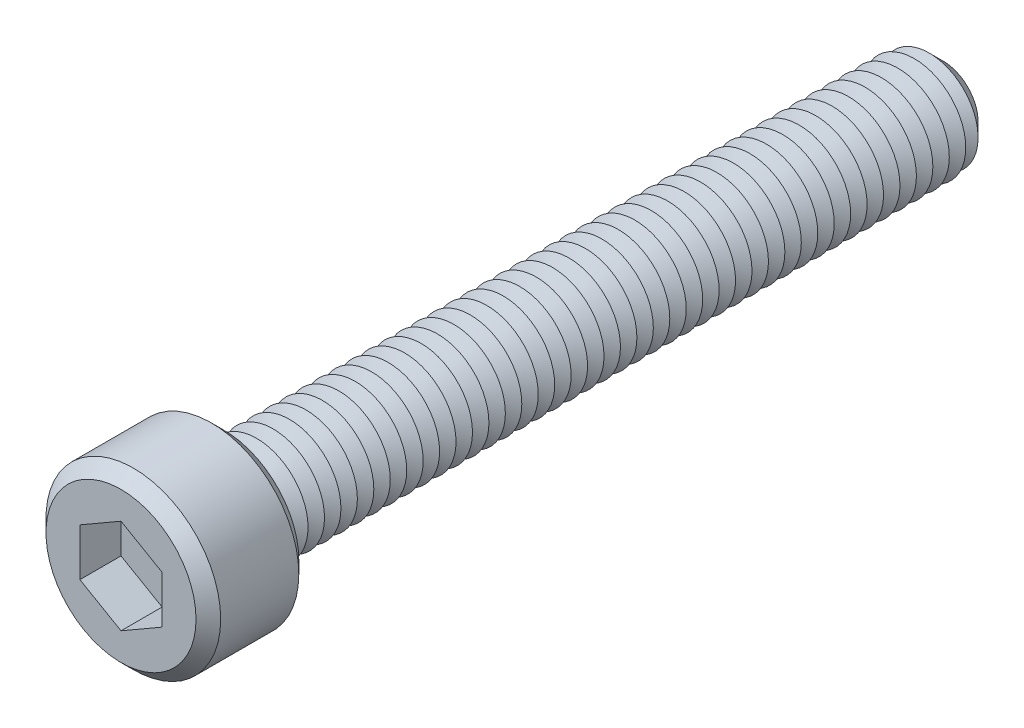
ISO-10303-21;
HEADER;
FILE_DESCRIPTION(('STEP AP214'),'2;1');
FILE_NAME('part.step','',(''),(''),'','','');
FILE_SCHEMA(('AUTOMOTIVE_DESIGN { 1 0 10303 214 1 1 1 1 }'));
ENDSEC;
DATA;
#1=APPLICATION_CONTEXT('core data for automotive mechanical design processes');
#2=APPLICATION_PROTOCOL_DEFINITION('international standard','automotive_design',2000,#1);
#3=PRODUCT_CONTEXT('',#1,'mechanical');
#4=PRODUCT('Part','Part','',(#3));
#5=PRODUCT_RELATED_PRODUCT_CATEGORY('part','',(#4));
#6=PRODUCT_DEFINITION_FORMATION('','',#4);
#7=PRODUCT_DEFINITION_CONTEXT('part definition',#1,'design');
#8=PRODUCT_DEFINITION('design','',#6,#7);
#9=PRODUCT_DEFINITION_SHAPE('','',#8);
#10=(LENGTH_UNIT() NAMED_UNIT(*) SI_UNIT(.MILLI.,.METRE.));
#11=(NAMED_UNIT(*) PLANE_ANGLE_UNIT() SI_UNIT($,.RADIAN.));
#12=(NAMED_UNIT(*) SI_UNIT($,.STERADIAN.) SOLID_ANGLE_UNIT());
#13=UNCERTAINTY_MEASURE_WITH_UNIT(LENGTH_MEASURE(1.E-05),#10,'distance_accuracy_value','');
#14=(GEOMETRIC_REPRESENTATION_CONTEXT(3) GLOBAL_UNCERTAINTY_ASSIGNED_CONTEXT((#13)) GLOBAL_UNIT_ASSIGNED_CONTEXT((#10,
#11,#12)) REPRESENTATION_CONTEXT('',''));
#15=CARTESIAN_POINT('',(0.,0.,0.));
#16=DIRECTION('',(0.,0.,1.));
#17=DIRECTION('',(1.,0.,0.));
#18=AXIS2_PLACEMENT_3D('',#15,#16,#17);
#19=CARTESIAN_POINT('',(0.,0.,5.));
#20=DIRECTION('',(0.,0.,-1.));
#21=DIRECTION('',(-1.,0.,0.));
#22=AXIS2_PLACEMENT_3D('',#19,#20,#21);
#23=CYLINDRICAL_SURFACE('',#22,4.25);
#24=CARTESIAN_POINT('',(0.,0.,0.599999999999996));
#25=DIRECTION('',(0.,0.,1.));
#26=DIRECTION('',(1.,0.,0.));
#27=AXIS2_PLACEMENT_3D('',#24,#25,#26);
#28=CIRCLE('',#27,4.25);
#29=CARTESIAN_POINT('',(4.25,0.,0.599999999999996));
#30=VERTEX_POINT('',#29);
#31=EDGE_CURVE('E520',#30,#30,#28,.T.);
#32=ORIENTED_EDGE('',*,*,#31,.T.);
#33=EDGE_LOOP('',(#32));
#34=FACE_BOUND('',#33,.T.);
#35=CARTESIAN_POINT('',(0.,0.,4.40000000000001));
#36=DIRECTION('',(0.,0.,1.));
#37=DIRECTION('',(1.,0.,0.));
#38=AXIS2_PLACEMENT_3D('',#35,#36,#37);
#39=CIRCLE('',#38,4.25);
#40=CARTESIAN_POINT('',(4.25,0.,4.40000000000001));
#41=VERTEX_POINT('',#40);
#42=EDGE_CURVE('E513',#41,#41,#39,.F.);
#43=ORIENTED_EDGE('',*,*,#42,.T.);
#44=EDGE_LOOP('',(#43));
#45=FACE_BOUND('',#44,.T.);
#46=ADVANCED_FACE('F39',(#34,#45),#23,.T.);
#47=CARTESIAN_POINT('',(0.,0.,5.));
#48=DIRECTION('',(0.,0.,1.));
#49=DIRECTION('',(1.,0.,0.));
#50=AXIS2_PLACEMENT_3D('',#47,#48,#49);
#51=PLANE('',#50);
#52=CARTESIAN_POINT('',(0.,0.,5.));
#53=DIRECTION('',(0.,0.,1.));
#54=DIRECTION('',(1.,0.,0.));
#55=AXIS2_PLACEMENT_3D('',#52,#53,#54);
#56=CIRCLE('',#55,3.65000000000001);
#57=CARTESIAN_POINT('',(3.65000000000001,0.,5.));
#58=VERTEX_POINT('',#57);
#59=EDGE_CURVE('E11',#58,#58,#56,.T.);
#60=ORIENTED_EDGE('',*,*,#59,.T.);
#61=EDGE_LOOP('',(#60));
#62=FACE_BOUND('',#61,.T.);
#63=DIRECTION('',(-0.866025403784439,0.5,0.));
#64=VECTOR('',#63,1.);
#65=CARTESIAN_POINT('',(2.,1.15470053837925,5.));
#66=LINE('',#65,#64);
#67=CARTESIAN_POINT('',(2.,1.15470053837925,5.));
#68=VERTEX_POINT('',#67);
#69=CARTESIAN_POINT('',(0.,2.3094010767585,5.));
#70=VERTEX_POINT('',#69);
#71=EDGE_CURVE('E55',#68,#70,#66,.T.);
#72=ORIENTED_EDGE('',*,*,#71,.F.);
#73=DIRECTION('',(0.,1.,0.));
#74=VECTOR('',#73,1.);
#75=CARTESIAN_POINT('',(2.,-1.15470053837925,5.));
#76=LINE('',#75,#74);
#77=CARTESIAN_POINT('',(2.,-1.15470053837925,5.));
#78=VERTEX_POINT('',#77);
#79=EDGE_CURVE('E150',#78,#68,#76,.T.);
#80=ORIENTED_EDGE('',*,*,#79,.F.);
#81=DIRECTION('',(0.866025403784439,0.5,0.));
#82=VECTOR('',#81,1.);
#83=CARTESIAN_POINT('',(0.,-2.3094010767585,5.));
#84=LINE('',#83,#82);
#85=CARTESIAN_POINT('',(0.,-2.3094010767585,5.));
#86=VERTEX_POINT('',#85);
#87=EDGE_CURVE('E147',#86,#78,#84,.T.);
#88=ORIENTED_EDGE('',*,*,#87,.F.);
#89=DIRECTION('',(0.866025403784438,-0.5,0.));
#90=VECTOR('',#89,1.);
#91=CARTESIAN_POINT('',(-2.,-1.15470053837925,5.));
#92=LINE('',#91,#90);
#93=CARTESIAN_POINT('',(-2.,-1.15470053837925,5.));
#94=VERTEX_POINT('',#93);
#95=EDGE_CURVE('E103',#94,#86,#92,.T.);
#96=ORIENTED_EDGE('',*,*,#95,.F.);
#97=DIRECTION('',(0.,-1.,0.));
#98=VECTOR('',#97,1.);
#99=CARTESIAN_POINT('',(-2.,1.15470053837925,5.));
#100=LINE('',#99,#98);
#101=CARTESIAN_POINT('',(-2.,1.15470053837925,5.));
#102=VERTEX_POINT('',#101);
#103=EDGE_CURVE('E141',#102,#94,#100,.T.);
#104=ORIENTED_EDGE('',*,*,#103,.F.);
#105=DIRECTION('',(-0.866025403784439,-0.5,0.));
#106=VECTOR('',#105,1.);
#107=CARTESIAN_POINT('',(0.,2.3094010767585,5.));
#108=LINE('',#107,#106);
#109=EDGE_CURVE('E136',#70,#102,#108,.T.);
#110=ORIENTED_EDGE('',*,*,#109,.F.);
#111=EDGE_LOOP('',(#72,#80,#88,#96,#104,#110));
#112=FACE_BOUND('',#111,.T.);
#113=ADVANCED_FACE('F538',(#62,#112),#51,.T.);
#114=CARTESIAN_POINT('',(0.,0.,0.));
#115=DIRECTION('',(0.,0.,1.));
#116=DIRECTION('',(1.,0.,0.));
#117=AXIS2_PLACEMENT_3D('',#114,#115,#116);
#118=PLANE('',#117);
#119=CARTESIAN_POINT('',(0.,0.,0.));
#120=DIRECTION('',(0.,0.,1.));
#121=DIRECTION('',(1.,0.,0.));
#122=AXIS2_PLACEMENT_3D('',#119,#120,#121);
#123=CIRCLE('',#122,3.65);
#124=CARTESIAN_POINT('',(3.65,0.,0.));
#125=VERTEX_POINT('',#124);
#126=EDGE_CURVE('E48',#125,#125,#123,.F.);
#127=ORIENTED_EDGE('',*,*,#126,.T.);
#128=EDGE_LOOP('',(#127));
#129=FACE_BOUND('',#128,.T.);
#130=CARTESIAN_POINT('',(0.,0.,0.));
#131=DIRECTION('',(0.,0.,1.));
#132=DIRECTION('',(1.,0.,0.));
#133=AXIS2_PLACEMENT_3D('',#130,#131,#132);
#134=CIRCLE('',#133,2.5);
#135=CARTESIAN_POINT('',(2.5,0.,0.));
#136=VERTEX_POINT('',#135);
#137=EDGE_CURVE('E505',#136,#136,#134,.T.);
#138=ORIENTED_EDGE('',*,*,#137,.T.);
#139=EDGE_LOOP('',(#138));
#140=FACE_BOUND('',#139,.T.);
#141=ADVANCED_FACE('F527',(#129,#140),#118,.F.);
#142=CARTESIAN_POINT('',(0.,0.,0.));
#143=DIRECTION('',(0.,0.,1.));
#144=DIRECTION('',(1.,0.,0.));
#145=AXIS2_PLACEMENT_3D('',#142,#143,#144);
#146=CONICAL_SURFACE('',#145,2.5,1.0471975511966);
#147=CARTESIAN_POINT('',(0.,0.,-0.400000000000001));
#148=DIRECTION('',(0.,0.,1.));
#149=DIRECTION('',(1.,0.,0.));
#150=AXIS2_PLACEMENT_3D('',#147,#148,#149);
#151=CIRCLE('',#150,1.80717967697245);
#152=CARTESIAN_POINT('',(1.80717967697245,0.,-0.400000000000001));
#153=VERTEX_POINT('',#152);
#154=EDGE_CURVE('E501',#153,#153,#151,.T.);
#155=ORIENTED_EDGE('',*,*,#154,.T.);
#156=EDGE_LOOP('',(#155));
#157=FACE_BOUND('',#156,.T.);
#158=ORIENTED_EDGE('',*,*,#137,.F.);
#159=EDGE_LOOP('',(#158));
#160=FACE_BOUND('',#159,.T.);
#161=ADVANCED_FACE('F932',(#157,#160),#146,.T.);
#162=CARTESIAN_POINT('',(0.,0.,-0.400000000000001));
#163=DIRECTION('',(0.,0.,-1.));
#164=DIRECTION('',(-1.,0.,0.));
#165=AXIS2_PLACEMENT_3D('',#162,#163,#164);
#166=CONICAL_SURFACE('',#165,1.80717967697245,1.0471975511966);
#167=CARTESIAN_POINT('',(0.,0.,-0.8));
#168=DIRECTION('',(0.,0.,1.));
#169=DIRECTION('',(1.,0.,0.));
#170=AXIS2_PLACEMENT_3D('',#167,#168,#169);
#171=CIRCLE('',#170,2.5);
#172=CARTESIAN_POINT('',(2.5,0.,-0.8));
#173=VERTEX_POINT('',#172);
#174=EDGE_CURVE('E497',#173,#173,#171,.T.);
#175=ORIENTED_EDGE('',*,*,#174,.T.);
#176=EDGE_LOOP('',(#175));
#177=FACE_BOUND('',#176,.T.);
#178=ORIENTED_EDGE('',*,*,#154,.F.);
#179=EDGE_LOOP('',(#178));
#180=FACE_BOUND('',#179,.T.);
#181=ADVANCED_FACE('F928',(#177,#180),#166,.T.);
#182=CARTESIAN_POINT('',(0.,0.,-0.8));
#183=DIRECTION('',(0.,0.,1.));
#184=DIRECTION('',(1.,0.,0.));
#185=AXIS2_PLACEMENT_3D('',#182,#183,#184);
#186=CONICAL_SURFACE('',#185,2.5,1.0471975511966);
#187=CARTESIAN_POINT('',(0.,0.,-1.2));
#188=DIRECTION('',(0.,0.,1.));
#189=DIRECTION('',(1.,0.,0.));
#190=AXIS2_PLACEMENT_3D('',#187,#188,#189);
#191=CIRCLE('',#190,1.80717967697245);
#192=CARTESIAN_POINT('',(1.80717967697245,0.,-1.2));
#193=VERTEX_POINT('',#192);
#194=EDGE_CURVE('E493',#193,#193,#191,.T.);
#195=ORIENTED_EDGE('',*,*,#194,.T.);
#196=EDGE_LOOP('',(#195));
#197=FACE_BOUND('',#196,.T.);
#198=ORIENTED_EDGE('',*,*,#174,.F.);
#199=EDGE_LOOP('',(#198));
#200=FACE_BOUND('',#199,.T.);
#201=ADVANCED_FACE('F924',(#197,#200),#186,.T.);
#202=CARTESIAN_POINT('',(0.,0.,-1.2));
#203=DIRECTION('',(0.,0.,-1.));
#204=DIRECTION('',(-1.,0.,0.));
#205=AXIS2_PLACEMENT_3D('',#202,#203,#204);
#206=CONICAL_SURFACE('',#205,1.80717967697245,1.0471975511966);
#207=CARTESIAN_POINT('',(0.,0.,-1.6));
#208=DIRECTION('',(0.,0.,1.));
#209=DIRECTION('',(1.,0.,0.));
#210=AXIS2_PLACEMENT_3D('',#207,#208,#209);
#211=CIRCLE('',#210,2.5);
#212=CARTESIAN_POINT('',(2.5,0.,-1.6));
#213=VERTEX_POINT('',#212);
#214=EDGE_CURVE('E489',#213,#213,#211,.T.);
#215=ORIENTED_EDGE('',*,*,#214,.T.);
#216=EDGE_LOOP('',(#215));
#217=FACE_BOUND('',#216,.T.);
#218=ORIENTED_EDGE('',*,*,#194,.F.);
#219=EDGE_LOOP('',(#218));
#220=FACE_BOUND('',#219,.T.);
#221=ADVANCED_FACE('F920',(#217,#220),#206,.T.);
#222=CARTESIAN_POINT('',(0.,0.,-1.6));
#223=DIRECTION('',(0.,0.,1.));
#224=DIRECTION('',(1.,0.,0.));
#225=AXIS2_PLACEMENT_3D('',#222,#223,#224);
#226=CONICAL_SURFACE('',#225,2.5,1.0471975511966);
#227=CARTESIAN_POINT('',(0.,0.,-2.));
#228=DIRECTION('',(0.,0.,1.));
#229=DIRECTION('',(1.,0.,0.));
#230=AXIS2_PLACEMENT_3D('',#227,#228,#229);
#231=CIRCLE('',#230,1.80717967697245);
#232=CARTESIAN_POINT('',(1.80717967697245,0.,-2.));
#233=VERTEX_POINT('',#232);
#234=EDGE_CURVE('E485',#233,#233,#231,.T.);
#235=ORIENTED_EDGE('',*,*,#234,.T.);
#236=EDGE_LOOP('',(#235));
#237=FACE_BOUND('',#236,.T.);
#238=ORIENTED_EDGE('',*,*,#214,.F.);
#239=EDGE_LOOP('',(#238));
#240=FACE_BOUND('',#239,.T.);
#241=ADVANCED_FACE('F916',(#237,#240),#226,.T.);
#242=CARTESIAN_POINT('',(0.,0.,-2.));
#243=DIRECTION('',(0.,0.,-1.));
#244=DIRECTION('',(-1.,0.,0.));
#245=AXIS2_PLACEMENT_3D('',#242,#243,#244);
#246=CONICAL_SURFACE('',#245,1.80717967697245,1.0471975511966);
#247=CARTESIAN_POINT('',(0.,0.,-2.4));
#248=DIRECTION('',(0.,0.,1.));
#249=DIRECTION('',(1.,0.,0.));
#250=AXIS2_PLACEMENT_3D('',#247,#248,#249);
#251=CIRCLE('',#250,2.5);
#252=CARTESIAN_POINT('',(2.5,0.,-2.4));
#253=VERTEX_POINT('',#252);
#254=EDGE_CURVE('E481',#253,#253,#251,.T.);
#255=ORIENTED_EDGE('',*,*,#254,.T.);
#256=EDGE_LOOP('',(#255));
#257=FACE_BOUND('',#256,.T.);
#258=ORIENTED_EDGE('',*,*,#234,.F.);
#259=EDGE_LOOP('',(#258));
#260=FACE_BOUND('',#259,.T.);
#261=ADVANCED_FACE('F912',(#257,#260),#246,.T.);
#262=CARTESIAN_POINT('',(0.,0.,-2.4));
#263=DIRECTION('',(0.,0.,1.));
#264=DIRECTION('',(1.,0.,0.));
#265=AXIS2_PLACEMENT_3D('',#262,#263,#264);
#266=CONICAL_SURFACE('',#265,2.5,1.0471975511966);
#267=CARTESIAN_POINT('',(0.,0.,-2.8));
#268=DIRECTION('',(0.,0.,1.));
#269=DIRECTION('',(1.,0.,0.));
#270=AXIS2_PLACEMENT_3D('',#267,#268,#269);
#271=CIRCLE('',#270,1.80717967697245);
#272=CARTESIAN_POINT('',(1.80717967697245,0.,-2.8));
#273=VERTEX_POINT('',#272);
#274=EDGE_CURVE('E477',#273,#273,#271,.T.);
#275=ORIENTED_EDGE('',*,*,#274,.T.);
#276=EDGE_LOOP('',(#275));
#277=FACE_BOUND('',#276,.T.);
#278=ORIENTED_EDGE('',*,*,#254,.F.);
#279=EDGE_LOOP('',(#278));
#280=FACE_BOUND('',#279,.T.);
#281=ADVANCED_FACE('F908',(#277,#280),#266,.T.);
#282=CARTESIAN_POINT('',(0.,0.,-2.8));
#283=DIRECTION('',(0.,0.,-1.));
#284=DIRECTION('',(-1.,0.,0.));
#285=AXIS2_PLACEMENT_3D('',#282,#283,#284);
#286=CONICAL_SURFACE('',#285,1.80717967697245,1.0471975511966);
#287=CARTESIAN_POINT('',(0.,0.,-3.2));
#288=DIRECTION('',(0.,0.,1.));
#289=DIRECTION('',(1.,0.,0.));
#290=AXIS2_PLACEMENT_3D('',#287,#288,#289);
#291=CIRCLE('',#290,2.5);
#292=CARTESIAN_POINT('',(2.5,0.,-3.2));
#293=VERTEX_POINT('',#292);
#294=EDGE_CURVE('E473',#293,#293,#291,.T.);
#295=ORIENTED_EDGE('',*,*,#294,.T.);
#296=EDGE_LOOP('',(#295));
#297=FACE_BOUND('',#296,.T.);
#298=ORIENTED_EDGE('',*,*,#274,.F.);
#299=EDGE_LOOP('',(#298));
#300=FACE_BOUND('',#299,.T.);
#301=ADVANCED_FACE('F904',(#297,#300),#286,.T.);
#302=CARTESIAN_POINT('',(0.,0.,-3.2));
#303=DIRECTION('',(0.,0.,1.));
#304=DIRECTION('',(1.,0.,0.));
#305=AXIS2_PLACEMENT_3D('',#302,#303,#304);
#306=CONICAL_SURFACE('',#305,2.5,1.0471975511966);
#307=CARTESIAN_POINT('',(0.,0.,-3.6));
#308=DIRECTION('',(0.,0.,1.));
#309=DIRECTION('',(1.,0.,0.));
#310=AXIS2_PLACEMENT_3D('',#307,#308,#309);
#311=CIRCLE('',#310,1.80717967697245);
#312=CARTESIAN_POINT('',(1.80717967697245,0.,-3.6));
#313=VERTEX_POINT('',#312);
#314=EDGE_CURVE('E469',#313,#313,#311,.T.);
#315=ORIENTED_EDGE('',*,*,#314,.T.);
#316=EDGE_LOOP('',(#315));
#317=FACE_BOUND('',#316,.T.);
#318=ORIENTED_EDGE('',*,*,#294,.F.);
#319=EDGE_LOOP('',(#318));
#320=FACE_BOUND('',#319,.T.);
#321=ADVANCED_FACE('F900',(#317,#320),#306,.T.);
#322=CARTESIAN_POINT('',(0.,0.,-3.6));
#323=DIRECTION('',(0.,0.,-1.));
#324=DIRECTION('',(-1.,0.,0.));
#325=AXIS2_PLACEMENT_3D('',#322,#323,#324);
#326=CONICAL_SURFACE('',#325,1.80717967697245,1.0471975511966);
#327=CARTESIAN_POINT('',(0.,0.,-4.));
#328=DIRECTION('',(0.,0.,1.));
#329=DIRECTION('',(1.,0.,0.));
#330=AXIS2_PLACEMENT_3D('',#327,#328,#329);
#331=CIRCLE('',#330,2.5);
#332=CARTESIAN_POINT('',(2.5,0.,-4.));
#333=VERTEX_POINT('',#332);
#334=EDGE_CURVE('E465',#333,#333,#331,.T.);
#335=ORIENTED_EDGE('',*,*,#334,.T.);
#336=EDGE_LOOP('',(#335));
#337=FACE_BOUND('',#336,.T.);
#338=ORIENTED_EDGE('',*,*,#314,.F.);
#339=EDGE_LOOP('',(#338));
#340=FACE_BOUND('',#339,.T.);
#341=ADVANCED_FACE('F896',(#337,#340),#326,.T.);
#342=CARTESIAN_POINT('',(0.,0.,-4.));
#343=DIRECTION('',(0.,0.,1.));
#344=DIRECTION('',(1.,0.,0.));
#345=AXIS2_PLACEMENT_3D('',#342,#343,#344);
#346=CONICAL_SURFACE('',#345,2.5,1.0471975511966);
#347=CARTESIAN_POINT('',(0.,0.,-4.4));
#348=DIRECTION('',(0.,0.,1.));
#349=DIRECTION('',(1.,0.,0.));
#350=AXIS2_PLACEMENT_3D('',#347,#348,#349);
#351=CIRCLE('',#350,1.80717967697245);
#352=CARTESIAN_POINT('',(1.80717967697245,0.,-4.4));
#353=VERTEX_POINT('',#352);
#354=EDGE_CURVE('E461',#353,#353,#351,.T.);
#355=ORIENTED_EDGE('',*,*,#354,.T.);
#356=EDGE_LOOP('',(#355));
#357=FACE_BOUND('',#356,.T.);
#358=ORIENTED_EDGE('',*,*,#334,.F.);
#359=EDGE_LOOP('',(#358));
#360=FACE_BOUND('',#359,.T.);
#361=ADVANCED_FACE('F892',(#357,#360),#346,.T.);
#362=CARTESIAN_POINT('',(0.,0.,-4.4));
#363=DIRECTION('',(0.,0.,-1.));
#364=DIRECTION('',(-1.,0.,0.));
#365=AXIS2_PLACEMENT_3D('',#362,#363,#364);
#366=CONICAL_SURFACE('',#365,1.80717967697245,1.0471975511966);
#367=CARTESIAN_POINT('',(0.,0.,-4.8));
#368=DIRECTION('',(0.,0.,1.));
#369=DIRECTION('',(1.,0.,0.));
#370=AXIS2_PLACEMENT_3D('',#367,#368,#369);
#371=CIRCLE('',#370,2.5);
#372=CARTESIAN_POINT('',(2.5,0.,-4.8));
#373=VERTEX_POINT('',#372);
#374=EDGE_CURVE('E457',#373,#373,#371,.T.);
#375=ORIENTED_EDGE('',*,*,#374,.T.);
#376=EDGE_LOOP('',(#375));
#377=FACE_BOUND('',#376,.T.);
#378=ORIENTED_EDGE('',*,*,#354,.F.);
#379=EDGE_LOOP('',(#378));
#380=FACE_BOUND('',#379,.T.);
#381=ADVANCED_FACE('F888',(#377,#380),#366,.T.);
#382=CARTESIAN_POINT('',(0.,0.,-4.8));
#383=DIRECTION('',(0.,0.,1.));
#384=DIRECTION('',(1.,0.,0.));
#385=AXIS2_PLACEMENT_3D('',#382,#383,#384);
#386=CONICAL_SURFACE('',#385,2.5,1.0471975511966);
#387=CARTESIAN_POINT('',(0.,0.,-5.2));
#388=DIRECTION('',(0.,0.,1.));
#389=DIRECTION('',(1.,0.,0.));
#390=AXIS2_PLACEMENT_3D('',#387,#388,#389);
#391=CIRCLE('',#390,1.80717967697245);
#392=CARTESIAN_POINT('',(1.80717967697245,0.,-5.2));
#393=VERTEX_POINT('',#392);
#394=EDGE_CURVE('E453',#393,#393,#391,.T.);
#395=ORIENTED_EDGE('',*,*,#394,.T.);
#396=EDGE_LOOP('',(#395));
#397=FACE_BOUND('',#396,.T.);
#398=ORIENTED_EDGE('',*,*,#374,.F.);
#399=EDGE_LOOP('',(#398));
#400=FACE_BOUND('',#399,.T.);
#401=ADVANCED_FACE('F884',(#397,#400),#386,.T.);
#402=CARTESIAN_POINT('',(0.,0.,-5.2));
#403=DIRECTION('',(0.,0.,-1.));
#404=DIRECTION('',(-1.,0.,0.));
#405=AXIS2_PLACEMENT_3D('',#402,#403,#404);
#406=CONICAL_SURFACE('',#405,1.80717967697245,1.0471975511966);
#407=CARTESIAN_POINT('',(0.,0.,-5.6));
#408=DIRECTION('',(0.,0.,1.));
#409=DIRECTION('',(1.,0.,0.));
#410=AXIS2_PLACEMENT_3D('',#407,#408,#409);
#411=CIRCLE('',#410,2.5);
#412=CARTESIAN_POINT('',(2.5,0.,-5.6));
#413=VERTEX_POINT('',#412);
#414=EDGE_CURVE('E449',#413,#413,#411,.T.);
#415=ORIENTED_EDGE('',*,*,#414,.T.);
#416=EDGE_LOOP('',(#415));
#417=FACE_BOUND('',#416,.T.);
#418=ORIENTED_EDGE('',*,*,#394,.F.);
#419=EDGE_LOOP('',(#418));
#420=FACE_BOUND('',#419,.T.);
#421=ADVANCED_FACE('F880',(#417,#420),#406,.T.);
#422=CARTESIAN_POINT('',(0.,0.,-5.6));
#423=DIRECTION('',(0.,0.,1.));
#424=DIRECTION('',(1.,0.,0.));
#425=AXIS2_PLACEMENT_3D('',#422,#423,#424);
#426=CONICAL_SURFACE('',#425,2.5,1.0471975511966);
#427=CARTESIAN_POINT('',(0.,0.,-6.));
#428=DIRECTION('',(0.,0.,1.));
#429=DIRECTION('',(1.,0.,0.));
#430=AXIS2_PLACEMENT_3D('',#427,#428,#429);
#431=CIRCLE('',#430,1.80717967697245);
#432=CARTESIAN_POINT('',(1.80717967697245,0.,-6.));
#433=VERTEX_POINT('',#432);
#434=EDGE_CURVE('E445',#433,#433,#431,.T.);
#435=ORIENTED_EDGE('',*,*,#434,.T.);
#436=EDGE_LOOP('',(#435));
#437=FACE_BOUND('',#436,.T.);
#438=ORIENTED_EDGE('',*,*,#414,.F.);
#439=EDGE_LOOP('',(#438));
#440=FACE_BOUND('',#439,.T.);
#441=ADVANCED_FACE('F876',(#437,#440),#426,.T.);
#442=CARTESIAN_POINT('',(0.,0.,-6.));
#443=DIRECTION('',(0.,0.,-1.));
#444=DIRECTION('',(-1.,0.,0.));
#445=AXIS2_PLACEMENT_3D('',#442,#443,#444);
#446=CONICAL_SURFACE('',#445,1.80717967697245,1.0471975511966);
#447=CARTESIAN_POINT('',(0.,0.,-6.4));
#448=DIRECTION('',(0.,0.,1.));
#449=DIRECTION('',(1.,0.,0.));
#450=AXIS2_PLACEMENT_3D('',#447,#448,#449);
#451=CIRCLE('',#450,2.5);
#452=CARTESIAN_POINT('',(2.5,0.,-6.4));
#453=VERTEX_POINT('',#452);
#454=EDGE_CURVE('E441',#453,#453,#451,.T.);
#455=ORIENTED_EDGE('',*,*,#454,.T.);
#456=EDGE_LOOP('',(#455));
#457=FACE_BOUND('',#456,.T.);
#458=ORIENTED_EDGE('',*,*,#434,.F.);
#459=EDGE_LOOP('',(#458));
#460=FACE_BOUND('',#459,.T.);
#461=ADVANCED_FACE('F872',(#457,#460),#446,.T.);
#462=CARTESIAN_POINT('',(0.,0.,-6.4));
#463=DIRECTION('',(0.,0.,1.));
#464=DIRECTION('',(1.,0.,0.));
#465=AXIS2_PLACEMENT_3D('',#462,#463,#464);
#466=CONICAL_SURFACE('',#465,2.5,1.0471975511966);
#467=CARTESIAN_POINT('',(0.,0.,-6.8));
#468=DIRECTION('',(0.,0.,1.));
#469=DIRECTION('',(1.,0.,0.));
#470=AXIS2_PLACEMENT_3D('',#467,#468,#469);
#471=CIRCLE('',#470,1.80717967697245);
#472=CARTESIAN_POINT('',(1.80717967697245,0.,-6.8));
#473=VERTEX_POINT('',#472);
#474=EDGE_CURVE('E437',#473,#473,#471,.T.);
#475=ORIENTED_EDGE('',*,*,#474,.T.);
#476=EDGE_LOOP('',(#475));
#477=FACE_BOUND('',#476,.T.);
#478=ORIENTED_EDGE('',*,*,#454,.F.);
#479=EDGE_LOOP('',(#478));
#480=FACE_BOUND('',#479,.T.);
#481=ADVANCED_FACE('F868',(#477,#480),#466,.T.);
#482=CARTESIAN_POINT('',(0.,0.,-6.8));
#483=DIRECTION('',(0.,0.,-1.));
#484=DIRECTION('',(-1.,0.,0.));
#485=AXIS2_PLACEMENT_3D('',#482,#483,#484);
#486=CONICAL_SURFACE('',#485,1.80717967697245,1.0471975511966);
#487=CARTESIAN_POINT('',(0.,0.,-7.2));
#488=DIRECTION('',(0.,0.,1.));
#489=DIRECTION('',(1.,0.,0.));
#490=AXIS2_PLACEMENT_3D('',#487,#488,#489);
#491=CIRCLE('',#490,2.5);
#492=CARTESIAN_POINT('',(2.5,0.,-7.2));
#493=VERTEX_POINT('',#492);
#494=EDGE_CURVE('E433',#493,#493,#491,.T.);
#495=ORIENTED_EDGE('',*,*,#494,.T.);
#496=EDGE_LOOP('',(#495));
#497=FACE_BOUND('',#496,.T.);
#498=ORIENTED_EDGE('',*,*,#474,.F.);
#499=EDGE_LOOP('',(#498));
#500=FACE_BOUND('',#499,.T.);
#501=ADVANCED_FACE('F864',(#497,#500),#486,.T.);
#502=CARTESIAN_POINT('',(0.,0.,-7.2));
#503=DIRECTION('',(0.,0.,1.));
#504=DIRECTION('',(1.,0.,0.));
#505=AXIS2_PLACEMENT_3D('',#502,#503,#504);
#506=CONICAL_SURFACE('',#505,2.5,1.0471975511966);
#507=CARTESIAN_POINT('',(0.,0.,-7.6));
#508=DIRECTION('',(0.,0.,1.));
#509=DIRECTION('',(1.,0.,0.));
#510=AXIS2_PLACEMENT_3D('',#507,#508,#509);
#511=CIRCLE('',#510,1.80717967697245);
#512=CARTESIAN_POINT('',(1.80717967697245,0.,-7.6));
#513=VERTEX_POINT('',#512);
#514=EDGE_CURVE('E429',#513,#513,#511,.T.);
#515=ORIENTED_EDGE('',*,*,#514,.T.);
#516=EDGE_LOOP('',(#515));
#517=FACE_BOUND('',#516,.T.);
#518=ORIENTED_EDGE('',*,*,#494,.F.);
#519=EDGE_LOOP('',(#518));
#520=FACE_BOUND('',#519,.T.);
#521=ADVANCED_FACE('F860',(#517,#520),#506,.T.);
#522=CARTESIAN_POINT('',(0.,0.,-7.6));
#523=DIRECTION('',(0.,0.,-1.));
#524=DIRECTION('',(-1.,0.,0.));
#525=AXIS2_PLACEMENT_3D('',#522,#523,#524);
#526=CONICAL_SURFACE('',#525,1.80717967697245,1.0471975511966);
#527=CARTESIAN_POINT('',(0.,0.,-8.));
#528=DIRECTION('',(0.,0.,1.));
#529=DIRECTION('',(1.,0.,0.));
#530=AXIS2_PLACEMENT_3D('',#527,#528,#529);
#531=CIRCLE('',#530,2.5);
#532=CARTESIAN_POINT('',(2.5,0.,-8.));
#533=VERTEX_POINT('',#532);
#534=EDGE_CURVE('E425',#533,#533,#531,.T.);
#535=ORIENTED_EDGE('',*,*,#534,.T.);
#536=EDGE_LOOP('',(#535));
#537=FACE_BOUND('',#536,.T.);
#538=ORIENTED_EDGE('',*,*,#514,.F.);
#539=EDGE_LOOP('',(#538));
#540=FACE_BOUND('',#539,.T.);
#541=ADVANCED_FACE('F856',(#537,#540),#526,.T.);
#542=CARTESIAN_POINT('',(0.,0.,-8.));
#543=DIRECTION('',(0.,0.,1.));
#544=DIRECTION('',(1.,0.,0.));
#545=AXIS2_PLACEMENT_3D('',#542,#543,#544);
#546=CONICAL_SURFACE('',#545,2.5,1.0471975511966);
#547=CARTESIAN_POINT('',(0.,0.,-8.4));
#548=DIRECTION('',(0.,0.,1.));
#549=DIRECTION('',(1.,0.,0.));
#550=AXIS2_PLACEMENT_3D('',#547,#548,#549);
#551=CIRCLE('',#550,1.80717967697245);
#552=CARTESIAN_POINT('',(1.80717967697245,0.,-8.4));
#553=VERTEX_POINT('',#552);
#554=EDGE_CURVE('E421',#553,#553,#551,.T.);
#555=ORIENTED_EDGE('',*,*,#554,.T.);
#556=EDGE_LOOP('',(#555));
#557=FACE_BOUND('',#556,.T.);
#558=ORIENTED_EDGE('',*,*,#534,.F.);
#559=EDGE_LOOP('',(#558));
#560=FACE_BOUND('',#559,.T.);
#561=ADVANCED_FACE('F852',(#557,#560),#546,.T.);
#562=CARTESIAN_POINT('',(0.,0.,-8.4));
#563=DIRECTION('',(0.,0.,-1.));
#564=DIRECTION('',(-1.,0.,0.));
#565=AXIS2_PLACEMENT_3D('',#562,#563,#564);
#566=CONICAL_SURFACE('',#565,1.80717967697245,1.0471975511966);
#567=CARTESIAN_POINT('',(0.,0.,-8.8));
#568=DIRECTION('',(0.,0.,1.));
#569=DIRECTION('',(1.,0.,0.));
#570=AXIS2_PLACEMENT_3D('',#567,#568,#569);
#571=CIRCLE('',#570,2.5);
#572=CARTESIAN_POINT('',(2.5,0.,-8.8));
#573=VERTEX_POINT('',#572);
#574=EDGE_CURVE('E417',#573,#573,#571,.T.);
#575=ORIENTED_EDGE('',*,*,#574,.T.);
#576=EDGE_LOOP('',(#575));
#577=FACE_BOUND('',#576,.T.);
#578=ORIENTED_EDGE('',*,*,#554,.F.);
#579=EDGE_LOOP('',(#578));
#580=FACE_BOUND('',#579,.T.);
#581=ADVANCED_FACE('F848',(#577,#580),#566,.T.);
#582=CARTESIAN_POINT('',(0.,0.,-8.8));
#583=DIRECTION('',(0.,0.,1.));
#584=DIRECTION('',(1.,0.,0.));
#585=AXIS2_PLACEMENT_3D('',#582,#583,#584);
#586=CONICAL_SURFACE('',#585,2.5,1.0471975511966);
#587=CARTESIAN_POINT('',(0.,0.,-9.2));
#588=DIRECTION('',(0.,0.,1.));
#589=DIRECTION('',(1.,0.,0.));
#590=AXIS2_PLACEMENT_3D('',#587,#588,#589);
#591=CIRCLE('',#590,1.80717967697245);
#592=CARTESIAN_POINT('',(1.80717967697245,0.,-9.2));
#593=VERTEX_POINT('',#592);
#594=EDGE_CURVE('E413',#593,#593,#591,.T.);
#595=ORIENTED_EDGE('',*,*,#594,.T.);
#596=EDGE_LOOP('',(#595));
#597=FACE_BOUND('',#596,.T.);
#598=ORIENTED_EDGE('',*,*,#574,.F.);
#599=EDGE_LOOP('',(#598));
#600=FACE_BOUND('',#599,.T.);
#601=ADVANCED_FACE('F844',(#597,#600),#586,.T.);
#602=CARTESIAN_POINT('',(0.,0.,-9.2));
#603=DIRECTION('',(0.,0.,-1.));
#604=DIRECTION('',(-1.,0.,0.));
#605=AXIS2_PLACEMENT_3D('',#602,#603,#604);
#606=CONICAL_SURFACE('',#605,1.80717967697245,1.0471975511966);
#607=CARTESIAN_POINT('',(0.,0.,-9.6));
#608=DIRECTION('',(0.,0.,1.));
#609=DIRECTION('',(1.,0.,0.));
#610=AXIS2_PLACEMENT_3D('',#607,#608,#609);
#611=CIRCLE('',#610,2.5);
#612=CARTESIAN_POINT('',(2.5,0.,-9.6));
#613=VERTEX_POINT('',#612);
#614=EDGE_CURVE('E409',#613,#613,#611,.T.);
#615=ORIENTED_EDGE('',*,*,#614,.T.);
#616=EDGE_LOOP('',(#615));
#617=FACE_BOUND('',#616,.T.);
#618=ORIENTED_EDGE('',*,*,#594,.F.);
#619=EDGE_LOOP('',(#618));
#620=FACE_BOUND('',#619,.T.);
#621=ADVANCED_FACE('F840',(#617,#620),#606,.T.);
#622=CARTESIAN_POINT('',(0.,0.,-9.6));
#623=DIRECTION('',(0.,0.,1.));
#624=DIRECTION('',(1.,0.,0.));
#625=AXIS2_PLACEMENT_3D('',#622,#623,#624);
#626=CONICAL_SURFACE('',#625,2.5,1.0471975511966);
#627=CARTESIAN_POINT('',(0.,0.,-10.));
#628=DIRECTION('',(0.,0.,1.));
#629=DIRECTION('',(1.,0.,0.));
#630=AXIS2_PLACEMENT_3D('',#627,#628,#629);
#631=CIRCLE('',#630,1.80717967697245);
#632=CARTESIAN_POINT('',(1.80717967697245,0.,-10.));
#633=VERTEX_POINT('',#632);
#634=EDGE_CURVE('E405',#633,#633,#631,.T.);
#635=ORIENTED_EDGE('',*,*,#634,.T.);
#636=EDGE_LOOP('',(#635));
#637=FACE_BOUND('',#636,.T.);
#638=ORIENTED_EDGE('',*,*,#614,.F.);
#639=EDGE_LOOP('',(#638));
#640=FACE_BOUND('',#639,.T.);
#641=ADVANCED_FACE('F836',(#637,#640),#626,.T.);
#642=CARTESIAN_POINT('',(0.,0.,-10.));
#643=DIRECTION('',(0.,0.,-1.));
#644=DIRECTION('',(-1.,0.,0.));
#645=AXIS2_PLACEMENT_3D('',#642,#643,#644);
#646=CONICAL_SURFACE('',#645,1.80717967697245,1.0471975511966);
#647=CARTESIAN_POINT('',(0.,0.,-10.4));
#648=DIRECTION('',(0.,0.,1.));
#649=DIRECTION('',(1.,0.,0.));
#650=AXIS2_PLACEMENT_3D('',#647,#648,#649);
#651=CIRCLE('',#650,2.5);
#652=CARTESIAN_POINT('',(2.5,0.,-10.4));
#653=VERTEX_POINT('',#652);
#654=EDGE_CURVE('E401',#653,#653,#651,.T.);
#655=ORIENTED_EDGE('',*,*,#654,.T.);
#656=EDGE_LOOP('',(#655));
#657=FACE_BOUND('',#656,.T.);
#658=ORIENTED_EDGE('',*,*,#634,.F.);
#659=EDGE_LOOP('',(#658));
#660=FACE_BOUND('',#659,.T.);
#661=ADVANCED_FACE('F832',(#657,#660),#646,.T.);
#662=CARTESIAN_POINT('',(0.,0.,-10.4));
#663=DIRECTION('',(0.,0.,1.));
#664=DIRECTION('',(1.,0.,0.));
#665=AXIS2_PLACEMENT_3D('',#662,#663,#664);
#666=CONICAL_SURFACE('',#665,2.5,1.0471975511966);
#667=CARTESIAN_POINT('',(0.,0.,-10.8));
#668=DIRECTION('',(0.,0.,1.));
#669=DIRECTION('',(1.,0.,0.));
#670=AXIS2_PLACEMENT_3D('',#667,#668,#669);
#671=CIRCLE('',#670,1.80717967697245);
#672=CARTESIAN_POINT('',(1.80717967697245,0.,-10.8));
#673=VERTEX_POINT('',#672);
#674=EDGE_CURVE('E397',#673,#673,#671,.T.);
#675=ORIENTED_EDGE('',*,*,#674,.T.);
#676=EDGE_LOOP('',(#675));
#677=FACE_BOUND('',#676,.T.);
#678=ORIENTED_EDGE('',*,*,#654,.F.);
#679=EDGE_LOOP('',(#678));
#680=FACE_BOUND('',#679,.T.);
#681=ADVANCED_FACE('F828',(#677,#680),#666,.T.);
#682=CARTESIAN_POINT('',(0.,0.,-10.8));
#683=DIRECTION('',(0.,0.,-1.));
#684=DIRECTION('',(-1.,0.,0.));
#685=AXIS2_PLACEMENT_3D('',#682,#683,#684);
#686=CONICAL_SURFACE('',#685,1.80717967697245,1.0471975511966);
#687=CARTESIAN_POINT('',(0.,0.,-11.2));
#688=DIRECTION('',(0.,0.,1.));
#689=DIRECTION('',(1.,0.,0.));
#690=AXIS2_PLACEMENT_3D('',#687,#688,#689);
#691=CIRCLE('',#690,2.5);
#692=CARTESIAN_POINT('',(2.5,0.,-11.2));
#693=VERTEX_POINT('',#692);
#694=EDGE_CURVE('E393',#693,#693,#691,.T.);
#695=ORIENTED_EDGE('',*,*,#694,.T.);
#696=EDGE_LOOP('',(#695));
#697=FACE_BOUND('',#696,.T.);
#698=ORIENTED_EDGE('',*,*,#674,.F.);
#699=EDGE_LOOP('',(#698));
#700=FACE_BOUND('',#699,.T.);
#701=ADVANCED_FACE('F824',(#697,#700),#686,.T.);
#702=CARTESIAN_POINT('',(0.,0.,-11.2));
#703=DIRECTION('',(0.,0.,1.));
#704=DIRECTION('',(1.,0.,0.));
#705=AXIS2_PLACEMENT_3D('',#702,#703,#704);
#706=CONICAL_SURFACE('',#705,2.5,1.0471975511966);
#707=CARTESIAN_POINT('',(0.,0.,-11.6));
#708=DIRECTION('',(0.,0.,1.));
#709=DIRECTION('',(1.,0.,0.));
#710=AXIS2_PLACEMENT_3D('',#707,#708,#709);
#711=CIRCLE('',#710,1.80717967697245);
#712=CARTESIAN_POINT('',(1.80717967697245,0.,-11.6));
#713=VERTEX_POINT('',#712);
#714=EDGE_CURVE('E389',#713,#713,#711,.T.);
#715=ORIENTED_EDGE('',*,*,#714,.T.);
#716=EDGE_LOOP('',(#715));
#717=FACE_BOUND('',#716,.T.);
#718=ORIENTED_EDGE('',*,*,#694,.F.);
#719=EDGE_LOOP('',(#718));
#720=FACE_BOUND('',#719,.T.);
#721=ADVANCED_FACE('F820',(#717,#720),#706,.T.);
#722=CARTESIAN_POINT('',(0.,0.,-11.6));
#723=DIRECTION('',(0.,0.,-1.));
#724=DIRECTION('',(-1.,0.,0.));
#725=AXIS2_PLACEMENT_3D('',#722,#723,#724);
#726=CONICAL_SURFACE('',#725,1.80717967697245,1.0471975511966);
#727=CARTESIAN_POINT('',(0.,0.,-12.));
#728=DIRECTION('',(0.,0.,1.));
#729=DIRECTION('',(1.,0.,0.));
#730=AXIS2_PLACEMENT_3D('',#727,#728,#729);
#731=CIRCLE('',#730,2.5);
#732=CARTESIAN_POINT('',(2.5,0.,-12.));
#733=VERTEX_POINT('',#732);
#734=EDGE_CURVE('E385',#733,#733,#731,.T.);
#735=ORIENTED_EDGE('',*,*,#734,.T.);
#736=EDGE_LOOP('',(#735));
#737=FACE_BOUND('',#736,.T.);
#738=ORIENTED_EDGE('',*,*,#714,.F.);
#739=EDGE_LOOP('',(#738));
#740=FACE_BOUND('',#739,.T.);
#741=ADVANCED_FACE('F816',(#737,#740),#726,.T.);
#742=CARTESIAN_POINT('',(0.,0.,-12.));
#743=DIRECTION('',(0.,0.,1.));
#744=DIRECTION('',(1.,0.,0.));
#745=AXIS2_PLACEMENT_3D('',#742,#743,#744);
#746=CONICAL_SURFACE('',#745,2.5,1.0471975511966);
#747=CARTESIAN_POINT('',(0.,0.,-12.4));
#748=DIRECTION('',(0.,0.,1.));
#749=DIRECTION('',(1.,0.,0.));
#750=AXIS2_PLACEMENT_3D('',#747,#748,#749);
#751=CIRCLE('',#750,1.80717967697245);
#752=CARTESIAN_POINT('',(1.80717967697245,0.,-12.4));
#753=VERTEX_POINT('',#752);
#754=EDGE_CURVE('E381',#753,#753,#751,.T.);
#755=ORIENTED_EDGE('',*,*,#754,.T.);
#756=EDGE_LOOP('',(#755));
#757=FACE_BOUND('',#756,.T.);
#758=ORIENTED_EDGE('',*,*,#734,.F.);
#759=EDGE_LOOP('',(#758));
#760=FACE_BOUND('',#759,.T.);
#761=ADVANCED_FACE('F812',(#757,#760),#746,.T.);
#762=CARTESIAN_POINT('',(0.,0.,-12.4));
#763=DIRECTION('',(0.,0.,-1.));
#764=DIRECTION('',(-1.,0.,0.));
#765=AXIS2_PLACEMENT_3D('',#762,#763,#764);
#766=CONICAL_SURFACE('',#765,1.80717967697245,1.0471975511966);
#767=CARTESIAN_POINT('',(0.,0.,-12.8));
#768=DIRECTION('',(0.,0.,1.));
#769=DIRECTION('',(1.,0.,0.));
#770=AXIS2_PLACEMENT_3D('',#767,#768,#769);
#771=CIRCLE('',#770,2.5);
#772=CARTESIAN_POINT('',(2.5,0.,-12.8));
#773=VERTEX_POINT('',#772);
#774=EDGE_CURVE('E377',#773,#773,#771,.T.);
#775=ORIENTED_EDGE('',*,*,#774,.T.);
#776=EDGE_LOOP('',(#775));
#777=FACE_BOUND('',#776,.T.);
#778=ORIENTED_EDGE('',*,*,#754,.F.);
#779=EDGE_LOOP('',(#778));
#780=FACE_BOUND('',#779,.T.);
#781=ADVANCED_FACE('F808',(#777,#780),#766,.T.);
#782=CARTESIAN_POINT('',(0.,0.,-12.8));
#783=DIRECTION('',(0.,0.,1.));
#784=DIRECTION('',(1.,0.,0.));
#785=AXIS2_PLACEMENT_3D('',#782,#783,#784);
#786=CONICAL_SURFACE('',#785,2.5,1.0471975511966);
#787=CARTESIAN_POINT('',(0.,0.,-13.2));
#788=DIRECTION('',(0.,0.,1.));
#789=DIRECTION('',(1.,0.,0.));
#790=AXIS2_PLACEMENT_3D('',#787,#788,#789);
#791=CIRCLE('',#790,1.80717967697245);
#792=CARTESIAN_POINT('',(1.80717967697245,0.,-13.2));
#793=VERTEX_POINT('',#792);
#794=EDGE_CURVE('E373',#793,#793,#791,.T.);
#795=ORIENTED_EDGE('',*,*,#794,.T.);
#796=EDGE_LOOP('',(#795));
#797=FACE_BOUND('',#796,.T.);
#798=ORIENTED_EDGE('',*,*,#774,.F.);
#799=EDGE_LOOP('',(#798));
#800=FACE_BOUND('',#799,.T.);
#801=ADVANCED_FACE('F804',(#797,#800),#786,.T.);
#802=CARTESIAN_POINT('',(0.,0.,-13.2));
#803=DIRECTION('',(0.,0.,-1.));
#804=DIRECTION('',(-1.,0.,0.));
#805=AXIS2_PLACEMENT_3D('',#802,#803,#804);
#806=CONICAL_SURFACE('',#805,1.80717967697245,1.0471975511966);
#807=CARTESIAN_POINT('',(0.,0.,-13.6));
#808=DIRECTION('',(0.,0.,1.));
#809=DIRECTION('',(1.,0.,0.));
#810=AXIS2_PLACEMENT_3D('',#807,#808,#809);
#811=CIRCLE('',#810,2.5);
#812=CARTESIAN_POINT('',(2.5,0.,-13.6));
#813=VERTEX_POINT('',#812);
#814=EDGE_CURVE('E369',#813,#813,#811,.T.);
#815=ORIENTED_EDGE('',*,*,#814,.T.);
#816=EDGE_LOOP('',(#815));
#817=FACE_BOUND('',#816,.T.);
#818=ORIENTED_EDGE('',*,*,#794,.F.);
#819=EDGE_LOOP('',(#818));
#820=FACE_BOUND('',#819,.T.);
#821=ADVANCED_FACE('F800',(#817,#820),#806,.T.);
#822=CARTESIAN_POINT('',(0.,0.,-13.6));
#823=DIRECTION('',(0.,0.,1.));
#824=DIRECTION('',(1.,0.,0.));
#825=AXIS2_PLACEMENT_3D('',#822,#823,#824);
#826=CONICAL_SURFACE('',#825,2.5,1.0471975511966);
#827=CARTESIAN_POINT('',(0.,0.,-14.));
#828=DIRECTION('',(0.,0.,1.));
#829=DIRECTION('',(1.,0.,0.));
#830=AXIS2_PLACEMENT_3D('',#827,#828,#829);
#831=CIRCLE('',#830,1.80717967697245);
#832=CARTESIAN_POINT('',(1.80717967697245,0.,-14.));
#833=VERTEX_POINT('',#832);
#834=EDGE_CURVE('E365',#833,#833,#831,.T.);
#835=ORIENTED_EDGE('',*,*,#834,.T.);
#836=EDGE_LOOP('',(#835));
#837=FACE_BOUND('',#836,.T.);
#838=ORIENTED_EDGE('',*,*,#814,.F.);
#839=EDGE_LOOP('',(#838));
#840=FACE_BOUND('',#839,.T.);
#841=ADVANCED_FACE('F796',(#837,#840),#826,.T.);
#842=CARTESIAN_POINT('',(0.,0.,-14.));
#843=DIRECTION('',(0.,0.,-1.));
#844=DIRECTION('',(-1.,0.,0.));
#845=AXIS2_PLACEMENT_3D('',#842,#843,#844);
#846=CONICAL_SURFACE('',#845,1.80717967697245,1.0471975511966);
#847=CARTESIAN_POINT('',(0.,0.,-14.4));
#848=DIRECTION('',(0.,0.,1.));
#849=DIRECTION('',(1.,0.,0.));
#850=AXIS2_PLACEMENT_3D('',#847,#848,#849);
#851=CIRCLE('',#850,2.5);
#852=CARTESIAN_POINT('',(2.5,0.,-14.4));
#853=VERTEX_POINT('',#852);
#854=EDGE_CURVE('E361',#853,#853,#851,.T.);
#855=ORIENTED_EDGE('',*,*,#854,.T.);
#856=EDGE_LOOP('',(#855));
#857=FACE_BOUND('',#856,.T.);
#858=ORIENTED_EDGE('',*,*,#834,.F.);
#859=EDGE_LOOP('',(#858));
#860=FACE_BOUND('',#859,.T.);
#861=ADVANCED_FACE('F792',(#857,#860),#846,.T.);
#862=CARTESIAN_POINT('',(0.,0.,-14.4));
#863=DIRECTION('',(0.,0.,1.));
#864=DIRECTION('',(1.,0.,0.));
#865=AXIS2_PLACEMENT_3D('',#862,#863,#864);
#866=CONICAL_SURFACE('',#865,2.5,1.0471975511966);
#867=CARTESIAN_POINT('',(0.,0.,-14.8));
#868=DIRECTION('',(0.,0.,1.));
#869=DIRECTION('',(1.,0.,0.));
#870=AXIS2_PLACEMENT_3D('',#867,#868,#869);
#871=CIRCLE('',#870,1.80717967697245);
#872=CARTESIAN_POINT('',(1.80717967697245,0.,-14.8));
#873=VERTEX_POINT('',#872);
#874=EDGE_CURVE('E357',#873,#873,#871,.T.);
#875=ORIENTED_EDGE('',*,*,#874,.T.);
#876=EDGE_LOOP('',(#875));
#877=FACE_BOUND('',#876,.T.);
#878=ORIENTED_EDGE('',*,*,#854,.F.);
#879=EDGE_LOOP('',(#878));
#880=FACE_BOUND('',#879,.T.);
#881=ADVANCED_FACE('F788',(#877,#880),#866,.T.);
#882=CARTESIAN_POINT('',(0.,0.,-14.8));
#883=DIRECTION('',(0.,0.,-1.));
#884=DIRECTION('',(-1.,0.,0.));
#885=AXIS2_PLACEMENT_3D('',#882,#883,#884);
#886=CONICAL_SURFACE('',#885,1.80717967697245,1.0471975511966);
#887=CARTESIAN_POINT('',(0.,0.,-15.2));
#888=DIRECTION('',(0.,0.,1.));
#889=DIRECTION('',(1.,0.,0.));
#890=AXIS2_PLACEMENT_3D('',#887,#888,#889);
#891=CIRCLE('',#890,2.5);
#892=CARTESIAN_POINT('',(2.5,0.,-15.2));
#893=VERTEX_POINT('',#892);
#894=EDGE_CURVE('E353',#893,#893,#891,.T.);
#895=ORIENTED_EDGE('',*,*,#894,.T.);
#896=EDGE_LOOP('',(#895));
#897=FACE_BOUND('',#896,.T.);
#898=ORIENTED_EDGE('',*,*,#874,.F.);
#899=EDGE_LOOP('',(#898));
#900=FACE_BOUND('',#899,.T.);
#901=ADVANCED_FACE('F784',(#897,#900),#886,.T.);
#902=CARTESIAN_POINT('',(0.,0.,-15.2));
#903=DIRECTION('',(0.,0.,1.));
#904=DIRECTION('',(1.,0.,0.));
#905=AXIS2_PLACEMENT_3D('',#902,#903,#904);
#906=CONICAL_SURFACE('',#905,2.5,1.0471975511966);
#907=CARTESIAN_POINT('',(0.,0.,-15.6));
#908=DIRECTION('',(0.,0.,1.));
#909=DIRECTION('',(1.,0.,0.));
#910=AXIS2_PLACEMENT_3D('',#907,#908,#909);
#911=CIRCLE('',#910,1.80717967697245);
#912=CARTESIAN_POINT('',(1.80717967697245,0.,-15.6));
#913=VERTEX_POINT('',#912);
#914=EDGE_CURVE('E349',#913,#913,#911,.T.);
#915=ORIENTED_EDGE('',*,*,#914,.T.);
#916=EDGE_LOOP('',(#915));
#917=FACE_BOUND('',#916,.T.);
#918=ORIENTED_EDGE('',*,*,#894,.F.);
#919=EDGE_LOOP('',(#918));
#920=FACE_BOUND('',#919,.T.);
#921=ADVANCED_FACE('F780',(#917,#920),#906,.T.);
#922=CARTESIAN_POINT('',(0.,0.,-15.6));
#923=DIRECTION('',(0.,0.,-1.));
#924=DIRECTION('',(-1.,0.,0.));
#925=AXIS2_PLACEMENT_3D('',#922,#923,#924);
#926=CONICAL_SURFACE('',#925,1.80717967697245,1.0471975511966);
#927=CARTESIAN_POINT('',(0.,0.,-16.));
#928=DIRECTION('',(0.,0.,1.));
#929=DIRECTION('',(1.,0.,0.));
#930=AXIS2_PLACEMENT_3D('',#927,#928,#929);
#931=CIRCLE('',#930,2.5);
#932=CARTESIAN_POINT('',(2.5,0.,-16.));
#933=VERTEX_POINT('',#932);
#934=EDGE_CURVE('E345',#933,#933,#931,.T.);
#935=ORIENTED_EDGE('',*,*,#934,.T.);
#936=EDGE_LOOP('',(#935));
#937=FACE_BOUND('',#936,.T.);
#938=ORIENTED_EDGE('',*,*,#914,.F.);
#939=EDGE_LOOP('',(#938));
#940=FACE_BOUND('',#939,.T.);
#941=ADVANCED_FACE('F776',(#937,#940),#926,.T.);
#942=CARTESIAN_POINT('',(0.,0.,-16.));
#943=DIRECTION('',(0.,0.,1.));
#944=DIRECTION('',(1.,0.,0.));
#945=AXIS2_PLACEMENT_3D('',#942,#943,#944);
#946=CONICAL_SURFACE('',#945,2.5,1.0471975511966);
#947=CARTESIAN_POINT('',(0.,0.,-16.4));
#948=DIRECTION('',(0.,0.,1.));
#949=DIRECTION('',(1.,0.,0.));
#950=AXIS2_PLACEMENT_3D('',#947,#948,#949);
#951=CIRCLE('',#950,1.80717967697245);
#952=CARTESIAN_POINT('',(1.80717967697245,0.,-16.4));
#953=VERTEX_POINT('',#952);
#954=EDGE_CURVE('E341',#953,#953,#951,.T.);
#955=ORIENTED_EDGE('',*,*,#954,.T.);
#956=EDGE_LOOP('',(#955));
#957=FACE_BOUND('',#956,.T.);
#958=ORIENTED_EDGE('',*,*,#934,.F.);
#959=EDGE_LOOP('',(#958));
#960=FACE_BOUND('',#959,.T.);
#961=ADVANCED_FACE('F772',(#957,#960),#946,.T.);
#962=CARTESIAN_POINT('',(0.,0.,-16.4));
#963=DIRECTION('',(0.,0.,-1.));
#964=DIRECTION('',(-1.,0.,0.));
#965=AXIS2_PLACEMENT_3D('',#962,#963,#964);
#966=CONICAL_SURFACE('',#965,1.80717967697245,1.0471975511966);
#967=CARTESIAN_POINT('',(0.,0.,-16.8));
#968=DIRECTION('',(0.,0.,1.));
#969=DIRECTION('',(1.,0.,0.));
#970=AXIS2_PLACEMENT_3D('',#967,#968,#969);
#971=CIRCLE('',#970,2.5);
#972=CARTESIAN_POINT('',(2.5,0.,-16.8));
#973=VERTEX_POINT('',#972);
#974=EDGE_CURVE('E337',#973,#973,#971,.T.);
#975=ORIENTED_EDGE('',*,*,#974,.T.);
#976=EDGE_LOOP('',(#975));
#977=FACE_BOUND('',#976,.T.);
#978=ORIENTED_EDGE('',*,*,#954,.F.);
#979=EDGE_LOOP('',(#978));
#980=FACE_BOUND('',#979,.T.);
#981=ADVANCED_FACE('F768',(#977,#980),#966,.T.);
#982=CARTESIAN_POINT('',(0.,0.,-16.8));
#983=DIRECTION('',(0.,0.,1.));
#984=DIRECTION('',(1.,0.,0.));
#985=AXIS2_PLACEMENT_3D('',#982,#983,#984);
#986=CONICAL_SURFACE('',#985,2.5,1.0471975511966);
#987=CARTESIAN_POINT('',(0.,0.,-17.2));
#988=DIRECTION('',(0.,0.,1.));
#989=DIRECTION('',(1.,0.,0.));
#990=AXIS2_PLACEMENT_3D('',#987,#988,#989);
#991=CIRCLE('',#990,1.80717967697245);
#992=CARTESIAN_POINT('',(1.80717967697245,0.,-17.2));
#993=VERTEX_POINT('',#992);
#994=EDGE_CURVE('E333',#993,#993,#991,.T.);
#995=ORIENTED_EDGE('',*,*,#994,.T.);
#996=EDGE_LOOP('',(#995));
#997=FACE_BOUND('',#996,.T.);
#998=ORIENTED_EDGE('',*,*,#974,.F.);
#999=EDGE_LOOP('',(#998));
#1000=FACE_BOUND('',#999,.T.);
#1001=ADVANCED_FACE('F764',(#997,#1000),#986,.T.);
#1002=CARTESIAN_POINT('',(0.,0.,-17.2));
#1003=DIRECTION('',(0.,0.,-1.));
#1004=DIRECTION('',(-1.,0.,0.));
#1005=AXIS2_PLACEMENT_3D('',#1002,#1003,#1004);
#1006=CONICAL_SURFACE('',#1005,1.80717967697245,1.0471975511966);
#1007=CARTESIAN_POINT('',(0.,0.,-17.6));
#1008=DIRECTION('',(0.,0.,1.));
#1009=DIRECTION('',(1.,0.,0.));
#1010=AXIS2_PLACEMENT_3D('',#1007,#1008,#1009);
#1011=CIRCLE('',#1010,2.5);
#1012=CARTESIAN_POINT('',(2.5,0.,-17.6));
#1013=VERTEX_POINT('',#1012);
#1014=EDGE_CURVE('E329',#1013,#1013,#1011,.T.);
#1015=ORIENTED_EDGE('',*,*,#1014,.T.);
#1016=EDGE_LOOP('',(#1015));
#1017=FACE_BOUND('',#1016,.T.);
#1018=ORIENTED_EDGE('',*,*,#994,.F.);
#1019=EDGE_LOOP('',(#1018));
#1020=FACE_BOUND('',#1019,.T.);
#1021=ADVANCED_FACE('F760',(#1017,#1020),#1006,.T.);
#1022=CARTESIAN_POINT('',(0.,0.,-17.6));
#1023=DIRECTION('',(0.,0.,1.));
#1024=DIRECTION('',(1.,0.,0.));
#1025=AXIS2_PLACEMENT_3D('',#1022,#1023,#1024);
#1026=CONICAL_SURFACE('',#1025,2.5,1.0471975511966);
#1027=CARTESIAN_POINT('',(0.,0.,-18.));
#1028=DIRECTION('',(0.,0.,1.));
#1029=DIRECTION('',(1.,0.,0.));
#1030=AXIS2_PLACEMENT_3D('',#1027,#1028,#1029);
#1031=CIRCLE('',#1030,1.80717967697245);
#1032=CARTESIAN_POINT('',(1.80717967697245,0.,-18.));
#1033=VERTEX_POINT('',#1032);
#1034=EDGE_CURVE('E325',#1033,#1033,#1031,.T.);
#1035=ORIENTED_EDGE('',*,*,#1034,.T.);
#1036=EDGE_LOOP('',(#1035));
#1037=FACE_BOUND('',#1036,.T.);
#1038=ORIENTED_EDGE('',*,*,#1014,.F.);
#1039=EDGE_LOOP('',(#1038));
#1040=FACE_BOUND('',#1039,.T.);
#1041=ADVANCED_FACE('F756',(#1037,#1040),#1026,.T.);
#1042=CARTESIAN_POINT('',(0.,0.,-18.));
#1043=DIRECTION('',(0.,0.,-1.));
#1044=DIRECTION('',(-1.,0.,0.));
#1045=AXIS2_PLACEMENT_3D('',#1042,#1043,#1044);
#1046=CONICAL_SURFACE('',#1045,1.80717967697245,1.0471975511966);
#1047=CARTESIAN_POINT('',(0.,0.,-18.4));
#1048=DIRECTION('',(0.,0.,1.));
#1049=DIRECTION('',(1.,0.,0.));
#1050=AXIS2_PLACEMENT_3D('',#1047,#1048,#1049);
#1051=CIRCLE('',#1050,2.5);
#1052=CARTESIAN_POINT('',(2.5,0.,-18.4));
#1053=VERTEX_POINT('',#1052);
#1054=EDGE_CURVE('E321',#1053,#1053,#1051,.T.);
#1055=ORIENTED_EDGE('',*,*,#1054,.T.);
#1056=EDGE_LOOP('',(#1055));
#1057=FACE_BOUND('',#1056,.T.);
#1058=ORIENTED_EDGE('',*,*,#1034,.F.);
#1059=EDGE_LOOP('',(#1058));
#1060=FACE_BOUND('',#1059,.T.);
#1061=ADVANCED_FACE('F752',(#1057,#1060),#1046,.T.);
#1062=CARTESIAN_POINT('',(0.,0.,-18.4));
#1063=DIRECTION('',(0.,0.,1.));
#1064=DIRECTION('',(1.,0.,0.));
#1065=AXIS2_PLACEMENT_3D('',#1062,#1063,#1064);
#1066=CONICAL_SURFACE('',#1065,2.5,1.0471975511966);
#1067=CARTESIAN_POINT('',(0.,0.,-18.8));
#1068=DIRECTION('',(0.,0.,1.));
#1069=DIRECTION('',(1.,0.,0.));
#1070=AXIS2_PLACEMENT_3D('',#1067,#1068,#1069);
#1071=CIRCLE('',#1070,1.80717967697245);
#1072=CARTESIAN_POINT('',(1.80717967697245,0.,-18.8));
#1073=VERTEX_POINT('',#1072);
#1074=EDGE_CURVE('E317',#1073,#1073,#1071,.T.);
#1075=ORIENTED_EDGE('',*,*,#1074,.T.);
#1076=EDGE_LOOP('',(#1075));
#1077=FACE_BOUND('',#1076,.T.);
#1078=ORIENTED_EDGE('',*,*,#1054,.F.);
#1079=EDGE_LOOP('',(#1078));
#1080=FACE_BOUND('',#1079,.T.);
#1081=ADVANCED_FACE('F748',(#1077,#1080),#1066,.T.);
#1082=CARTESIAN_POINT('',(0.,0.,-18.8));
#1083=DIRECTION('',(0.,0.,-1.));
#1084=DIRECTION('',(-1.,0.,0.));
#1085=AXIS2_PLACEMENT_3D('',#1082,#1083,#1084);
#1086=CONICAL_SURFACE('',#1085,1.80717967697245,1.0471975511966);
#1087=CARTESIAN_POINT('',(0.,0.,-19.2));
#1088=DIRECTION('',(0.,0.,1.));
#1089=DIRECTION('',(1.,0.,0.));
#1090=AXIS2_PLACEMENT_3D('',#1087,#1088,#1089);
#1091=CIRCLE('',#1090,2.5);
#1092=CARTESIAN_POINT('',(2.5,0.,-19.2));
#1093=VERTEX_POINT('',#1092);
#1094=EDGE_CURVE('E313',#1093,#1093,#1091,.T.);
#1095=ORIENTED_EDGE('',*,*,#1094,.T.);
#1096=EDGE_LOOP('',(#1095));
#1097=FACE_BOUND('',#1096,.T.);
#1098=ORIENTED_EDGE('',*,*,#1074,.F.);
#1099=EDGE_LOOP('',(#1098));
#1100=FACE_BOUND('',#1099,.T.);
#1101=ADVANCED_FACE('F744',(#1097,#1100),#1086,.T.);
#1102=CARTESIAN_POINT('',(0.,0.,-19.2));
#1103=DIRECTION('',(0.,0.,1.));
#1104=DIRECTION('',(1.,0.,0.));
#1105=AXIS2_PLACEMENT_3D('',#1102,#1103,#1104);
#1106=CONICAL_SURFACE('',#1105,2.5,1.0471975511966);
#1107=CARTESIAN_POINT('',(0.,0.,-19.6));
#1108=DIRECTION('',(0.,0.,1.));
#1109=DIRECTION('',(1.,0.,0.));
#1110=AXIS2_PLACEMENT_3D('',#1107,#1108,#1109);
#1111=CIRCLE('',#1110,1.80717967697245);
#1112=CARTESIAN_POINT('',(1.80717967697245,0.,-19.6));
#1113=VERTEX_POINT('',#1112);
#1114=EDGE_CURVE('E309',#1113,#1113,#1111,.T.);
#1115=ORIENTED_EDGE('',*,*,#1114,.T.);
#1116=EDGE_LOOP('',(#1115));
#1117=FACE_BOUND('',#1116,.T.);
#1118=ORIENTED_EDGE('',*,*,#1094,.F.);
#1119=EDGE_LOOP('',(#1118));
#1120=FACE_BOUND('',#1119,.T.);
#1121=ADVANCED_FACE('F740',(#1117,#1120),#1106,.T.);
#1122=CARTESIAN_POINT('',(0.,0.,-19.6));
#1123=DIRECTION('',(0.,0.,-1.));
#1124=DIRECTION('',(-1.,0.,0.));
#1125=AXIS2_PLACEMENT_3D('',#1122,#1123,#1124);
#1126=CONICAL_SURFACE('',#1125,1.80717967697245,1.0471975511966);
#1127=CARTESIAN_POINT('',(0.,0.,-20.));
#1128=DIRECTION('',(0.,0.,1.));
#1129=DIRECTION('',(1.,0.,0.));
#1130=AXIS2_PLACEMENT_3D('',#1127,#1128,#1129);
#1131=CIRCLE('',#1130,2.5);
#1132=CARTESIAN_POINT('',(2.5,0.,-20.));
#1133=VERTEX_POINT('',#1132);
#1134=EDGE_CURVE('E305',#1133,#1133,#1131,.T.);
#1135=ORIENTED_EDGE('',*,*,#1134,.T.);
#1136=EDGE_LOOP('',(#1135));
#1137=FACE_BOUND('',#1136,.T.);
#1138=ORIENTED_EDGE('',*,*,#1114,.F.);
#1139=EDGE_LOOP('',(#1138));
#1140=FACE_BOUND('',#1139,.T.);
#1141=ADVANCED_FACE('F736',(#1137,#1140),#1126,.T.);
#1142=CARTESIAN_POINT('',(0.,0.,-20.));
#1143=DIRECTION('',(0.,0.,1.));
#1144=DIRECTION('',(1.,0.,0.));
#1145=AXIS2_PLACEMENT_3D('',#1142,#1143,#1144);
#1146=CONICAL_SURFACE('',#1145,2.5,1.0471975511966);
#1147=CARTESIAN_POINT('',(0.,0.,-20.4));
#1148=DIRECTION('',(0.,0.,1.));
#1149=DIRECTION('',(1.,0.,0.));
#1150=AXIS2_PLACEMENT_3D('',#1147,#1148,#1149);
#1151=CIRCLE('',#1150,1.80717967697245);
#1152=CARTESIAN_POINT('',(1.80717967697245,0.,-20.4));
#1153=VERTEX_POINT('',#1152);
#1154=EDGE_CURVE('E301',#1153,#1153,#1151,.T.);
#1155=ORIENTED_EDGE('',*,*,#1154,.T.);
#1156=EDGE_LOOP('',(#1155));
#1157=FACE_BOUND('',#1156,.T.);
#1158=ORIENTED_EDGE('',*,*,#1134,.F.);
#1159=EDGE_LOOP('',(#1158));
#1160=FACE_BOUND('',#1159,.T.);
#1161=ADVANCED_FACE('F732',(#1157,#1160),#1146,.T.);
#1162=CARTESIAN_POINT('',(0.,0.,-20.4));
#1163=DIRECTION('',(0.,0.,-1.));
#1164=DIRECTION('',(-1.,0.,0.));
#1165=AXIS2_PLACEMENT_3D('',#1162,#1163,#1164);
#1166=CONICAL_SURFACE('',#1165,1.80717967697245,1.0471975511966);
#1167=CARTESIAN_POINT('',(0.,0.,-20.8));
#1168=DIRECTION('',(0.,0.,1.));
#1169=DIRECTION('',(1.,0.,0.));
#1170=AXIS2_PLACEMENT_3D('',#1167,#1168,#1169);
#1171=CIRCLE('',#1170,2.5);
#1172=CARTESIAN_POINT('',(2.5,0.,-20.8));
#1173=VERTEX_POINT('',#1172);
#1174=EDGE_CURVE('E297',#1173,#1173,#1171,.T.);
#1175=ORIENTED_EDGE('',*,*,#1174,.T.);
#1176=EDGE_LOOP('',(#1175));
#1177=FACE_BOUND('',#1176,.T.);
#1178=ORIENTED_EDGE('',*,*,#1154,.F.);
#1179=EDGE_LOOP('',(#1178));
#1180=FACE_BOUND('',#1179,.T.);
#1181=ADVANCED_FACE('F728',(#1177,#1180),#1166,.T.);
#1182=CARTESIAN_POINT('',(0.,0.,-20.8));
#1183=DIRECTION('',(0.,0.,1.));
#1184=DIRECTION('',(1.,0.,0.));
#1185=AXIS2_PLACEMENT_3D('',#1182,#1183,#1184);
#1186=CONICAL_SURFACE('',#1185,2.5,1.0471975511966);
#1187=CARTESIAN_POINT('',(0.,0.,-21.2));
#1188=DIRECTION('',(0.,0.,1.));
#1189=DIRECTION('',(1.,0.,0.));
#1190=AXIS2_PLACEMENT_3D('',#1187,#1188,#1189);
#1191=CIRCLE('',#1190,1.80717967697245);
#1192=CARTESIAN_POINT('',(1.80717967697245,0.,-21.2));
#1193=VERTEX_POINT('',#1192);
#1194=EDGE_CURVE('E293',#1193,#1193,#1191,.T.);
#1195=ORIENTED_EDGE('',*,*,#1194,.T.);
#1196=EDGE_LOOP('',(#1195));
#1197=FACE_BOUND('',#1196,.T.);
#1198=ORIENTED_EDGE('',*,*,#1174,.F.);
#1199=EDGE_LOOP('',(#1198));
#1200=FACE_BOUND('',#1199,.T.);
#1201=ADVANCED_FACE('F724',(#1197,#1200),#1186,.T.);
#1202=CARTESIAN_POINT('',(0.,0.,-21.2));
#1203=DIRECTION('',(0.,0.,-1.));
#1204=DIRECTION('',(-1.,0.,0.));
#1205=AXIS2_PLACEMENT_3D('',#1202,#1203,#1204);
#1206=CONICAL_SURFACE('',#1205,1.80717967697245,1.0471975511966);
#1207=CARTESIAN_POINT('',(0.,0.,-21.6));
#1208=DIRECTION('',(0.,0.,1.));
#1209=DIRECTION('',(1.,0.,0.));
#1210=AXIS2_PLACEMENT_3D('',#1207,#1208,#1209);
#1211=CIRCLE('',#1210,2.5);
#1212=CARTESIAN_POINT('',(2.5,0.,-21.6));
#1213=VERTEX_POINT('',#1212);
#1214=EDGE_CURVE('E289',#1213,#1213,#1211,.T.);
#1215=ORIENTED_EDGE('',*,*,#1214,.T.);
#1216=EDGE_LOOP('',(#1215));
#1217=FACE_BOUND('',#1216,.T.);
#1218=ORIENTED_EDGE('',*,*,#1194,.F.);
#1219=EDGE_LOOP('',(#1218));
#1220=FACE_BOUND('',#1219,.T.);
#1221=ADVANCED_FACE('F720',(#1217,#1220),#1206,.T.);
#1222=CARTESIAN_POINT('',(0.,0.,-21.6));
#1223=DIRECTION('',(0.,0.,1.));
#1224=DIRECTION('',(1.,0.,0.));
#1225=AXIS2_PLACEMENT_3D('',#1222,#1223,#1224);
#1226=CONICAL_SURFACE('',#1225,2.5,1.0471975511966);
#1227=CARTESIAN_POINT('',(0.,0.,-22.));
#1228=DIRECTION('',(0.,0.,1.));
#1229=DIRECTION('',(1.,0.,0.));
#1230=AXIS2_PLACEMENT_3D('',#1227,#1228,#1229);
#1231=CIRCLE('',#1230,1.80717967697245);
#1232=CARTESIAN_POINT('',(1.80717967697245,0.,-22.));
#1233=VERTEX_POINT('',#1232);
#1234=EDGE_CURVE('E285',#1233,#1233,#1231,.T.);
#1235=ORIENTED_EDGE('',*,*,#1234,.T.);
#1236=EDGE_LOOP('',(#1235));
#1237=FACE_BOUND('',#1236,.T.);
#1238=ORIENTED_EDGE('',*,*,#1214,.F.);
#1239=EDGE_LOOP('',(#1238));
#1240=FACE_BOUND('',#1239,.T.);
#1241=ADVANCED_FACE('F716',(#1237,#1240),#1226,.T.);
#1242=CARTESIAN_POINT('',(0.,0.,-22.));
#1243=DIRECTION('',(0.,0.,-1.));
#1244=DIRECTION('',(-1.,0.,0.));
#1245=AXIS2_PLACEMENT_3D('',#1242,#1243,#1244);
#1246=CONICAL_SURFACE('',#1245,1.80717967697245,1.0471975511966);
#1247=CARTESIAN_POINT('',(0.,0.,-22.4));
#1248=DIRECTION('',(0.,0.,1.));
#1249=DIRECTION('',(1.,0.,0.));
#1250=AXIS2_PLACEMENT_3D('',#1247,#1248,#1249);
#1251=CIRCLE('',#1250,2.5);
#1252=CARTESIAN_POINT('',(2.5,0.,-22.4));
#1253=VERTEX_POINT('',#1252);
#1254=EDGE_CURVE('E281',#1253,#1253,#1251,.T.);
#1255=ORIENTED_EDGE('',*,*,#1254,.T.);
#1256=EDGE_LOOP('',(#1255));
#1257=FACE_BOUND('',#1256,.T.);
#1258=ORIENTED_EDGE('',*,*,#1234,.F.);
#1259=EDGE_LOOP('',(#1258));
#1260=FACE_BOUND('',#1259,.T.);
#1261=ADVANCED_FACE('F712',(#1257,#1260),#1246,.T.);
#1262=CARTESIAN_POINT('',(0.,0.,-22.4));
#1263=DIRECTION('',(0.,0.,1.));
#1264=DIRECTION('',(1.,0.,0.));
#1265=AXIS2_PLACEMENT_3D('',#1262,#1263,#1264);
#1266=CONICAL_SURFACE('',#1265,2.5,1.0471975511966);
#1267=CARTESIAN_POINT('',(0.,0.,-22.8));
#1268=DIRECTION('',(0.,0.,1.));
#1269=DIRECTION('',(1.,0.,0.));
#1270=AXIS2_PLACEMENT_3D('',#1267,#1268,#1269);
#1271=CIRCLE('',#1270,1.80717967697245);
#1272=CARTESIAN_POINT('',(1.80717967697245,0.,-22.8));
#1273=VERTEX_POINT('',#1272);
#1274=EDGE_CURVE('E277',#1273,#1273,#1271,.T.);
#1275=ORIENTED_EDGE('',*,*,#1274,.T.);
#1276=EDGE_LOOP('',(#1275));
#1277=FACE_BOUND('',#1276,.T.);
#1278=ORIENTED_EDGE('',*,*,#1254,.F.);
#1279=EDGE_LOOP('',(#1278));
#1280=FACE_BOUND('',#1279,.T.);
#1281=ADVANCED_FACE('F708',(#1277,#1280),#1266,.T.);
#1282=CARTESIAN_POINT('',(0.,0.,-22.8));
#1283=DIRECTION('',(0.,0.,-1.));
#1284=DIRECTION('',(-1.,0.,0.));
#1285=AXIS2_PLACEMENT_3D('',#1282,#1283,#1284);
#1286=CONICAL_SURFACE('',#1285,1.80717967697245,1.0471975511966);
#1287=CARTESIAN_POINT('',(0.,0.,-23.2));
#1288=DIRECTION('',(0.,0.,1.));
#1289=DIRECTION('',(1.,0.,0.));
#1290=AXIS2_PLACEMENT_3D('',#1287,#1288,#1289);
#1291=CIRCLE('',#1290,2.5);
#1292=CARTESIAN_POINT('',(2.5,0.,-23.2));
#1293=VERTEX_POINT('',#1292);
#1294=EDGE_CURVE('E273',#1293,#1293,#1291,.T.);
#1295=ORIENTED_EDGE('',*,*,#1294,.T.);
#1296=EDGE_LOOP('',(#1295));
#1297=FACE_BOUND('',#1296,.T.);
#1298=ORIENTED_EDGE('',*,*,#1274,.F.);
#1299=EDGE_LOOP('',(#1298));
#1300=FACE_BOUND('',#1299,.T.);
#1301=ADVANCED_FACE('F704',(#1297,#1300),#1286,.T.);
#1302=CARTESIAN_POINT('',(0.,0.,-23.2));
#1303=DIRECTION('',(0.,0.,1.));
#1304=DIRECTION('',(1.,0.,0.));
#1305=AXIS2_PLACEMENT_3D('',#1302,#1303,#1304);
#1306=CONICAL_SURFACE('',#1305,2.5,1.0471975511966);
#1307=CARTESIAN_POINT('',(0.,0.,-23.6));
#1308=DIRECTION('',(0.,0.,1.));
#1309=DIRECTION('',(1.,0.,0.));
#1310=AXIS2_PLACEMENT_3D('',#1307,#1308,#1309);
#1311=CIRCLE('',#1310,1.80717967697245);
#1312=CARTESIAN_POINT('',(1.80717967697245,0.,-23.6));
#1313=VERTEX_POINT('',#1312);
#1314=EDGE_CURVE('E269',#1313,#1313,#1311,.T.);
#1315=ORIENTED_EDGE('',*,*,#1314,.T.);
#1316=EDGE_LOOP('',(#1315));
#1317=FACE_BOUND('',#1316,.T.);
#1318=ORIENTED_EDGE('',*,*,#1294,.F.);
#1319=EDGE_LOOP('',(#1318));
#1320=FACE_BOUND('',#1319,.T.);
#1321=ADVANCED_FACE('F700',(#1317,#1320),#1306,.T.);
#1322=CARTESIAN_POINT('',(0.,0.,-23.6));
#1323=DIRECTION('',(0.,0.,-1.));
#1324=DIRECTION('',(-1.,0.,0.));
#1325=AXIS2_PLACEMENT_3D('',#1322,#1323,#1324);
#1326=CONICAL_SURFACE('',#1325,1.80717967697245,1.0471975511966);
#1327=CARTESIAN_POINT('',(0.,0.,-24.));
#1328=DIRECTION('',(0.,0.,1.));
#1329=DIRECTION('',(1.,0.,0.));
#1330=AXIS2_PLACEMENT_3D('',#1327,#1328,#1329);
#1331=CIRCLE('',#1330,2.5);
#1332=CARTESIAN_POINT('',(2.5,0.,-24.));
#1333=VERTEX_POINT('',#1332);
#1334=EDGE_CURVE('E265',#1333,#1333,#1331,.T.);
#1335=ORIENTED_EDGE('',*,*,#1334,.T.);
#1336=EDGE_LOOP('',(#1335));
#1337=FACE_BOUND('',#1336,.T.);
#1338=ORIENTED_EDGE('',*,*,#1314,.F.);
#1339=EDGE_LOOP('',(#1338));
#1340=FACE_BOUND('',#1339,.T.);
#1341=ADVANCED_FACE('F696',(#1337,#1340),#1326,.T.);
#1342=CARTESIAN_POINT('',(0.,0.,-24.));
#1343=DIRECTION('',(0.,0.,1.));
#1344=DIRECTION('',(1.,0.,0.));
#1345=AXIS2_PLACEMENT_3D('',#1342,#1343,#1344);
#1346=CONICAL_SURFACE('',#1345,2.5,1.0471975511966);
#1347=CARTESIAN_POINT('',(0.,0.,-24.4));
#1348=DIRECTION('',(0.,0.,1.));
#1349=DIRECTION('',(1.,0.,0.));
#1350=AXIS2_PLACEMENT_3D('',#1347,#1348,#1349);
#1351=CIRCLE('',#1350,1.80717967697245);
#1352=CARTESIAN_POINT('',(1.80717967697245,0.,-24.4));
#1353=VERTEX_POINT('',#1352);
#1354=EDGE_CURVE('E261',#1353,#1353,#1351,.T.);
#1355=ORIENTED_EDGE('',*,*,#1354,.T.);
#1356=EDGE_LOOP('',(#1355));
#1357=FACE_BOUND('',#1356,.T.);
#1358=ORIENTED_EDGE('',*,*,#1334,.F.);
#1359=EDGE_LOOP('',(#1358));
#1360=FACE_BOUND('',#1359,.T.);
#1361=ADVANCED_FACE('F692',(#1357,#1360),#1346,.T.);
#1362=CARTESIAN_POINT('',(0.,0.,-24.4));
#1363=DIRECTION('',(0.,0.,-1.));
#1364=DIRECTION('',(-1.,0.,0.));
#1365=AXIS2_PLACEMENT_3D('',#1362,#1363,#1364);
#1366=CONICAL_SURFACE('',#1365,1.80717967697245,1.0471975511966);
#1367=CARTESIAN_POINT('',(0.,0.,-24.8));
#1368=DIRECTION('',(0.,0.,1.));
#1369=DIRECTION('',(1.,0.,0.));
#1370=AXIS2_PLACEMENT_3D('',#1367,#1368,#1369);
#1371=CIRCLE('',#1370,2.5);
#1372=CARTESIAN_POINT('',(2.5,0.,-24.8));
#1373=VERTEX_POINT('',#1372);
#1374=EDGE_CURVE('E257',#1373,#1373,#1371,.T.);
#1375=ORIENTED_EDGE('',*,*,#1374,.T.);
#1376=EDGE_LOOP('',(#1375));
#1377=FACE_BOUND('',#1376,.T.);
#1378=ORIENTED_EDGE('',*,*,#1354,.F.);
#1379=EDGE_LOOP('',(#1378));
#1380=FACE_BOUND('',#1379,.T.);
#1381=ADVANCED_FACE('F688',(#1377,#1380),#1366,.T.);
#1382=CARTESIAN_POINT('',(0.,0.,-24.8));
#1383=DIRECTION('',(0.,0.,1.));
#1384=DIRECTION('',(1.,0.,0.));
#1385=AXIS2_PLACEMENT_3D('',#1382,#1383,#1384);
#1386=CONICAL_SURFACE('',#1385,2.5,1.0471975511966);
#1387=CARTESIAN_POINT('',(0.,0.,-25.2));
#1388=DIRECTION('',(0.,0.,1.));
#1389=DIRECTION('',(1.,0.,0.));
#1390=AXIS2_PLACEMENT_3D('',#1387,#1388,#1389);
#1391=CIRCLE('',#1390,1.80717967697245);
#1392=CARTESIAN_POINT('',(1.80717967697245,0.,-25.2));
#1393=VERTEX_POINT('',#1392);
#1394=EDGE_CURVE('E253',#1393,#1393,#1391,.T.);
#1395=ORIENTED_EDGE('',*,*,#1394,.T.);
#1396=EDGE_LOOP('',(#1395));
#1397=FACE_BOUND('',#1396,.T.);
#1398=ORIENTED_EDGE('',*,*,#1374,.F.);
#1399=EDGE_LOOP('',(#1398));
#1400=FACE_BOUND('',#1399,.T.);
#1401=ADVANCED_FACE('F684',(#1397,#1400),#1386,.T.);
#1402=CARTESIAN_POINT('',(0.,0.,-25.2));
#1403=DIRECTION('',(0.,0.,-1.));
#1404=DIRECTION('',(-1.,0.,0.));
#1405=AXIS2_PLACEMENT_3D('',#1402,#1403,#1404);
#1406=CONICAL_SURFACE('',#1405,1.80717967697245,1.0471975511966);
#1407=CARTESIAN_POINT('',(0.,0.,-25.6));
#1408=DIRECTION('',(0.,0.,1.));
#1409=DIRECTION('',(1.,0.,0.));
#1410=AXIS2_PLACEMENT_3D('',#1407,#1408,#1409);
#1411=CIRCLE('',#1410,2.5);
#1412=CARTESIAN_POINT('',(2.5,0.,-25.6));
#1413=VERTEX_POINT('',#1412);
#1414=EDGE_CURVE('E249',#1413,#1413,#1411,.T.);
#1415=ORIENTED_EDGE('',*,*,#1414,.T.);
#1416=EDGE_LOOP('',(#1415));
#1417=FACE_BOUND('',#1416,.T.);
#1418=ORIENTED_EDGE('',*,*,#1394,.F.);
#1419=EDGE_LOOP('',(#1418));
#1420=FACE_BOUND('',#1419,.T.);
#1421=ADVANCED_FACE('F680',(#1417,#1420),#1406,.T.);
#1422=CARTESIAN_POINT('',(0.,0.,-25.6));
#1423=DIRECTION('',(0.,0.,1.));
#1424=DIRECTION('',(1.,0.,0.));
#1425=AXIS2_PLACEMENT_3D('',#1422,#1423,#1424);
#1426=CONICAL_SURFACE('',#1425,2.5,1.0471975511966);
#1427=CARTESIAN_POINT('',(0.,0.,-26.));
#1428=DIRECTION('',(0.,0.,1.));
#1429=DIRECTION('',(1.,0.,0.));
#1430=AXIS2_PLACEMENT_3D('',#1427,#1428,#1429);
#1431=CIRCLE('',#1430,1.80717967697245);
#1432=CARTESIAN_POINT('',(1.80717967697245,0.,-26.));
#1433=VERTEX_POINT('',#1432);
#1434=EDGE_CURVE('E245',#1433,#1433,#1431,.T.);
#1435=ORIENTED_EDGE('',*,*,#1434,.T.);
#1436=EDGE_LOOP('',(#1435));
#1437=FACE_BOUND('',#1436,.T.);
#1438=ORIENTED_EDGE('',*,*,#1414,.F.);
#1439=EDGE_LOOP('',(#1438));
#1440=FACE_BOUND('',#1439,.T.);
#1441=ADVANCED_FACE('F676',(#1437,#1440),#1426,.T.);
#1442=CARTESIAN_POINT('',(0.,0.,-26.));
#1443=DIRECTION('',(0.,0.,-1.));
#1444=DIRECTION('',(-1.,0.,0.));
#1445=AXIS2_PLACEMENT_3D('',#1442,#1443,#1444);
#1446=CONICAL_SURFACE('',#1445,1.80717967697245,1.0471975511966);
#1447=CARTESIAN_POINT('',(0.,0.,-26.4));
#1448=DIRECTION('',(0.,0.,1.));
#1449=DIRECTION('',(1.,0.,0.));
#1450=AXIS2_PLACEMENT_3D('',#1447,#1448,#1449);
#1451=CIRCLE('',#1450,2.5);
#1452=CARTESIAN_POINT('',(2.5,0.,-26.4));
#1453=VERTEX_POINT('',#1452);
#1454=EDGE_CURVE('E241',#1453,#1453,#1451,.T.);
#1455=ORIENTED_EDGE('',*,*,#1454,.T.);
#1456=EDGE_LOOP('',(#1455));
#1457=FACE_BOUND('',#1456,.T.);
#1458=ORIENTED_EDGE('',*,*,#1434,.F.);
#1459=EDGE_LOOP('',(#1458));
#1460=FACE_BOUND('',#1459,.T.);
#1461=ADVANCED_FACE('F672',(#1457,#1460),#1446,.T.);
#1462=CARTESIAN_POINT('',(0.,0.,-26.4));
#1463=DIRECTION('',(0.,0.,1.));
#1464=DIRECTION('',(1.,0.,0.));
#1465=AXIS2_PLACEMENT_3D('',#1462,#1463,#1464);
#1466=CONICAL_SURFACE('',#1465,2.5,1.0471975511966);
#1467=CARTESIAN_POINT('',(0.,0.,-26.8));
#1468=DIRECTION('',(0.,0.,1.));
#1469=DIRECTION('',(1.,0.,0.));
#1470=AXIS2_PLACEMENT_3D('',#1467,#1468,#1469);
#1471=CIRCLE('',#1470,1.80717967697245);
#1472=CARTESIAN_POINT('',(1.80717967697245,0.,-26.8));
#1473=VERTEX_POINT('',#1472);
#1474=EDGE_CURVE('E237',#1473,#1473,#1471,.T.);
#1475=ORIENTED_EDGE('',*,*,#1474,.T.);
#1476=EDGE_LOOP('',(#1475));
#1477=FACE_BOUND('',#1476,.T.);
#1478=ORIENTED_EDGE('',*,*,#1454,.F.);
#1479=EDGE_LOOP('',(#1478));
#1480=FACE_BOUND('',#1479,.T.);
#1481=ADVANCED_FACE('F668',(#1477,#1480),#1466,.T.);
#1482=CARTESIAN_POINT('',(0.,0.,-26.8));
#1483=DIRECTION('',(0.,0.,-1.));
#1484=DIRECTION('',(-1.,0.,0.));
#1485=AXIS2_PLACEMENT_3D('',#1482,#1483,#1484);
#1486=CONICAL_SURFACE('',#1485,1.80717967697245,1.0471975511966);
#1487=CARTESIAN_POINT('',(0.,0.,-27.2));
#1488=DIRECTION('',(0.,0.,1.));
#1489=DIRECTION('',(1.,0.,0.));
#1490=AXIS2_PLACEMENT_3D('',#1487,#1488,#1489);
#1491=CIRCLE('',#1490,2.5);
#1492=CARTESIAN_POINT('',(2.5,0.,-27.2));
#1493=VERTEX_POINT('',#1492);
#1494=EDGE_CURVE('E233',#1493,#1493,#1491,.T.);
#1495=ORIENTED_EDGE('',*,*,#1494,.T.);
#1496=EDGE_LOOP('',(#1495));
#1497=FACE_BOUND('',#1496,.T.);
#1498=ORIENTED_EDGE('',*,*,#1474,.F.);
#1499=EDGE_LOOP('',(#1498));
#1500=FACE_BOUND('',#1499,.T.);
#1501=ADVANCED_FACE('F664',(#1497,#1500),#1486,.T.);
#1502=CARTESIAN_POINT('',(0.,0.,-27.2));
#1503=DIRECTION('',(0.,0.,1.));
#1504=DIRECTION('',(1.,0.,0.));
#1505=AXIS2_PLACEMENT_3D('',#1502,#1503,#1504);
#1506=CONICAL_SURFACE('',#1505,2.5,1.0471975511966);
#1507=CARTESIAN_POINT('',(0.,0.,-27.6));
#1508=DIRECTION('',(0.,0.,1.));
#1509=DIRECTION('',(1.,0.,0.));
#1510=AXIS2_PLACEMENT_3D('',#1507,#1508,#1509);
#1511=CIRCLE('',#1510,1.80717967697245);
#1512=CARTESIAN_POINT('',(1.80717967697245,0.,-27.6));
#1513=VERTEX_POINT('',#1512);
#1514=EDGE_CURVE('E229',#1513,#1513,#1511,.T.);
#1515=ORIENTED_EDGE('',*,*,#1514,.T.);
#1516=EDGE_LOOP('',(#1515));
#1517=FACE_BOUND('',#1516,.T.);
#1518=ORIENTED_EDGE('',*,*,#1494,.F.);
#1519=EDGE_LOOP('',(#1518));
#1520=FACE_BOUND('',#1519,.T.);
#1521=ADVANCED_FACE('F660',(#1517,#1520),#1506,.T.);
#1522=CARTESIAN_POINT('',(0.,0.,-27.6));
#1523=DIRECTION('',(0.,0.,-1.));
#1524=DIRECTION('',(-1.,0.,0.));
#1525=AXIS2_PLACEMENT_3D('',#1522,#1523,#1524);
#1526=CONICAL_SURFACE('',#1525,1.80717967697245,1.0471975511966);
#1527=CARTESIAN_POINT('',(0.,0.,-28.));
#1528=DIRECTION('',(0.,0.,1.));
#1529=DIRECTION('',(1.,0.,0.));
#1530=AXIS2_PLACEMENT_3D('',#1527,#1528,#1529);
#1531=CIRCLE('',#1530,2.5);
#1532=CARTESIAN_POINT('',(2.5,0.,-28.));
#1533=VERTEX_POINT('',#1532);
#1534=EDGE_CURVE('E225',#1533,#1533,#1531,.T.);
#1535=ORIENTED_EDGE('',*,*,#1534,.T.);
#1536=EDGE_LOOP('',(#1535));
#1537=FACE_BOUND('',#1536,.T.);
#1538=ORIENTED_EDGE('',*,*,#1514,.F.);
#1539=EDGE_LOOP('',(#1538));
#1540=FACE_BOUND('',#1539,.T.);
#1541=ADVANCED_FACE('F656',(#1537,#1540),#1526,.T.);
#1542=CARTESIAN_POINT('',(0.,0.,-28.));
#1543=DIRECTION('',(0.,0.,1.));
#1544=DIRECTION('',(1.,0.,0.));
#1545=AXIS2_PLACEMENT_3D('',#1542,#1543,#1544);
#1546=CONICAL_SURFACE('',#1545,2.5,1.0471975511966);
#1547=CARTESIAN_POINT('',(0.,0.,-28.4));
#1548=DIRECTION('',(0.,0.,1.));
#1549=DIRECTION('',(1.,0.,0.));
#1550=AXIS2_PLACEMENT_3D('',#1547,#1548,#1549);
#1551=CIRCLE('',#1550,1.80717967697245);
#1552=CARTESIAN_POINT('',(1.80717967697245,0.,-28.4));
#1553=VERTEX_POINT('',#1552);
#1554=EDGE_CURVE('E221',#1553,#1553,#1551,.T.);
#1555=ORIENTED_EDGE('',*,*,#1554,.T.);
#1556=EDGE_LOOP('',(#1555));
#1557=FACE_BOUND('',#1556,.T.);
#1558=ORIENTED_EDGE('',*,*,#1534,.F.);
#1559=EDGE_LOOP('',(#1558));
#1560=FACE_BOUND('',#1559,.T.);
#1561=ADVANCED_FACE('F652',(#1557,#1560),#1546,.T.);
#1562=CARTESIAN_POINT('',(0.,0.,-28.4));
#1563=DIRECTION('',(0.,0.,-1.));
#1564=DIRECTION('',(-1.,0.,0.));
#1565=AXIS2_PLACEMENT_3D('',#1562,#1563,#1564);
#1566=CONICAL_SURFACE('',#1565,1.80717967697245,1.0471975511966);
#1567=CARTESIAN_POINT('',(0.,0.,-28.8));
#1568=DIRECTION('',(0.,0.,1.));
#1569=DIRECTION('',(1.,0.,0.));
#1570=AXIS2_PLACEMENT_3D('',#1567,#1568,#1569);
#1571=CIRCLE('',#1570,2.5);
#1572=CARTESIAN_POINT('',(2.5,0.,-28.8));
#1573=VERTEX_POINT('',#1572);
#1574=EDGE_CURVE('E217',#1573,#1573,#1571,.T.);
#1575=ORIENTED_EDGE('',*,*,#1574,.T.);
#1576=EDGE_LOOP('',(#1575));
#1577=FACE_BOUND('',#1576,.T.);
#1578=ORIENTED_EDGE('',*,*,#1554,.F.);
#1579=EDGE_LOOP('',(#1578));
#1580=FACE_BOUND('',#1579,.T.);
#1581=ADVANCED_FACE('F648',(#1577,#1580),#1566,.T.);
#1582=CARTESIAN_POINT('',(0.,0.,-28.8));
#1583=DIRECTION('',(0.,0.,1.));
#1584=DIRECTION('',(1.,0.,0.));
#1585=AXIS2_PLACEMENT_3D('',#1582,#1583,#1584);
#1586=CONICAL_SURFACE('',#1585,2.5,1.0471975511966);
#1587=CARTESIAN_POINT('',(0.,0.,-29.2));
#1588=DIRECTION('',(0.,0.,1.));
#1589=DIRECTION('',(1.,0.,0.));
#1590=AXIS2_PLACEMENT_3D('',#1587,#1588,#1589);
#1591=CIRCLE('',#1590,1.80717967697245);
#1592=CARTESIAN_POINT('',(1.80717967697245,0.,-29.2));
#1593=VERTEX_POINT('',#1592);
#1594=EDGE_CURVE('E213',#1593,#1593,#1591,.T.);
#1595=ORIENTED_EDGE('',*,*,#1594,.T.);
#1596=EDGE_LOOP('',(#1595));
#1597=FACE_BOUND('',#1596,.T.);
#1598=ORIENTED_EDGE('',*,*,#1574,.F.);
#1599=EDGE_LOOP('',(#1598));
#1600=FACE_BOUND('',#1599,.T.);
#1601=ADVANCED_FACE('F644',(#1597,#1600),#1586,.T.);
#1602=CARTESIAN_POINT('',(0.,0.,-29.2));
#1603=DIRECTION('',(0.,0.,-1.));
#1604=DIRECTION('',(-1.,0.,0.));
#1605=AXIS2_PLACEMENT_3D('',#1602,#1603,#1604);
#1606=CONICAL_SURFACE('',#1605,1.80717967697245,1.0471975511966);
#1607=CARTESIAN_POINT('',(0.,0.,-29.6));
#1608=DIRECTION('',(0.,0.,1.));
#1609=DIRECTION('',(1.,0.,0.));
#1610=AXIS2_PLACEMENT_3D('',#1607,#1608,#1609);
#1611=CIRCLE('',#1610,2.5);
#1612=CARTESIAN_POINT('',(2.5,0.,-29.6));
#1613=VERTEX_POINT('',#1612);
#1614=EDGE_CURVE('E209',#1613,#1613,#1611,.T.);
#1615=ORIENTED_EDGE('',*,*,#1614,.T.);
#1616=EDGE_LOOP('',(#1615));
#1617=FACE_BOUND('',#1616,.T.);
#1618=ORIENTED_EDGE('',*,*,#1594,.F.);
#1619=EDGE_LOOP('',(#1618));
#1620=FACE_BOUND('',#1619,.T.);
#1621=ADVANCED_FACE('F640',(#1617,#1620),#1606,.T.);
#1622=CARTESIAN_POINT('',(0.,0.,-29.6));
#1623=DIRECTION('',(0.,0.,1.));
#1624=DIRECTION('',(1.,0.,0.));
#1625=AXIS2_PLACEMENT_3D('',#1622,#1623,#1624);
#1626=CONICAL_SURFACE('',#1625,2.5,1.0471975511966);
#1627=CARTESIAN_POINT('',(0.,0.,-30.));
#1628=DIRECTION('',(0.,0.,1.));
#1629=DIRECTION('',(1.,0.,0.));
#1630=AXIS2_PLACEMENT_3D('',#1627,#1628,#1629);
#1631=CIRCLE('',#1630,1.80717967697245);
#1632=CARTESIAN_POINT('',(1.80717967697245,0.,-30.));
#1633=VERTEX_POINT('',#1632);
#1634=EDGE_CURVE('E205',#1633,#1633,#1631,.T.);
#1635=ORIENTED_EDGE('',*,*,#1634,.T.);
#1636=EDGE_LOOP('',(#1635));
#1637=FACE_BOUND('',#1636,.T.);
#1638=ORIENTED_EDGE('',*,*,#1614,.F.);
#1639=EDGE_LOOP('',(#1638));
#1640=FACE_BOUND('',#1639,.T.);
#1641=ADVANCED_FACE('F636',(#1637,#1640),#1626,.T.);
#1642=CARTESIAN_POINT('',(0.,0.,-30.));
#1643=DIRECTION('',(0.,0.,-1.));
#1644=DIRECTION('',(-1.,0.,0.));
#1645=AXIS2_PLACEMENT_3D('',#1642,#1643,#1644);
#1646=CONICAL_SURFACE('',#1645,1.80717967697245,1.0471975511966);
#1647=CARTESIAN_POINT('',(0.,0.,-30.4));
#1648=DIRECTION('',(0.,0.,1.));
#1649=DIRECTION('',(1.,0.,0.));
#1650=AXIS2_PLACEMENT_3D('',#1647,#1648,#1649);
#1651=CIRCLE('',#1650,2.5);
#1652=CARTESIAN_POINT('',(2.5,0.,-30.4));
#1653=VERTEX_POINT('',#1652);
#1654=EDGE_CURVE('E201',#1653,#1653,#1651,.T.);
#1655=ORIENTED_EDGE('',*,*,#1654,.T.);
#1656=EDGE_LOOP('',(#1655));
#1657=FACE_BOUND('',#1656,.T.);
#1658=ORIENTED_EDGE('',*,*,#1634,.F.);
#1659=EDGE_LOOP('',(#1658));
#1660=FACE_BOUND('',#1659,.T.);
#1661=ADVANCED_FACE('F632',(#1657,#1660),#1646,.T.);
#1662=CARTESIAN_POINT('',(0.,0.,-30.4));
#1663=DIRECTION('',(0.,0.,1.));
#1664=DIRECTION('',(1.,0.,0.));
#1665=AXIS2_PLACEMENT_3D('',#1662,#1663,#1664);
#1666=CONICAL_SURFACE('',#1665,2.5,1.0471975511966);
#1667=CARTESIAN_POINT('',(0.,0.,-30.8));
#1668=DIRECTION('',(0.,0.,1.));
#1669=DIRECTION('',(1.,0.,0.));
#1670=AXIS2_PLACEMENT_3D('',#1667,#1668,#1669);
#1671=CIRCLE('',#1670,1.80717967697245);
#1672=CARTESIAN_POINT('',(1.80717967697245,0.,-30.8));
#1673=VERTEX_POINT('',#1672);
#1674=EDGE_CURVE('E197',#1673,#1673,#1671,.T.);
#1675=ORIENTED_EDGE('',*,*,#1674,.T.);
#1676=EDGE_LOOP('',(#1675));
#1677=FACE_BOUND('',#1676,.T.);
#1678=ORIENTED_EDGE('',*,*,#1654,.F.);
#1679=EDGE_LOOP('',(#1678));
#1680=FACE_BOUND('',#1679,.T.);
#1681=ADVANCED_FACE('F628',(#1677,#1680),#1666,.T.);
#1682=CARTESIAN_POINT('',(0.,0.,-30.8));
#1683=DIRECTION('',(0.,0.,-1.));
#1684=DIRECTION('',(-1.,0.,0.));
#1685=AXIS2_PLACEMENT_3D('',#1682,#1683,#1684);
#1686=CONICAL_SURFACE('',#1685,1.80717967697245,1.0471975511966);
#1687=CARTESIAN_POINT('',(0.,0.,-31.2));
#1688=DIRECTION('',(0.,0.,1.));
#1689=DIRECTION('',(1.,0.,0.));
#1690=AXIS2_PLACEMENT_3D('',#1687,#1688,#1689);
#1691=CIRCLE('',#1690,2.5);
#1692=CARTESIAN_POINT('',(2.5,0.,-31.2));
#1693=VERTEX_POINT('',#1692);
#1694=EDGE_CURVE('E193',#1693,#1693,#1691,.T.);
#1695=ORIENTED_EDGE('',*,*,#1694,.T.);
#1696=EDGE_LOOP('',(#1695));
#1697=FACE_BOUND('',#1696,.T.);
#1698=ORIENTED_EDGE('',*,*,#1674,.F.);
#1699=EDGE_LOOP('',(#1698));
#1700=FACE_BOUND('',#1699,.T.);
#1701=ADVANCED_FACE('F624',(#1697,#1700),#1686,.T.);
#1702=CARTESIAN_POINT('',(0.,0.,-31.2));
#1703=DIRECTION('',(0.,0.,1.));
#1704=DIRECTION('',(1.,0.,0.));
#1705=AXIS2_PLACEMENT_3D('',#1702,#1703,#1704);
#1706=CONICAL_SURFACE('',#1705,2.5,1.0471975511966);
#1707=CARTESIAN_POINT('',(0.,0.,-31.6));
#1708=DIRECTION('',(0.,0.,1.));
#1709=DIRECTION('',(1.,0.,0.));
#1710=AXIS2_PLACEMENT_3D('',#1707,#1708,#1709);
#1711=CIRCLE('',#1710,1.80717967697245);
#1712=CARTESIAN_POINT('',(1.80717967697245,0.,-31.6));
#1713=VERTEX_POINT('',#1712);
#1714=EDGE_CURVE('E189',#1713,#1713,#1711,.T.);
#1715=ORIENTED_EDGE('',*,*,#1714,.T.);
#1716=EDGE_LOOP('',(#1715));
#1717=FACE_BOUND('',#1716,.T.);
#1718=ORIENTED_EDGE('',*,*,#1694,.F.);
#1719=EDGE_LOOP('',(#1718));
#1720=FACE_BOUND('',#1719,.T.);
#1721=ADVANCED_FACE('F620',(#1717,#1720),#1706,.T.);
#1722=CARTESIAN_POINT('',(0.,0.,-31.6));
#1723=DIRECTION('',(0.,0.,-1.));
#1724=DIRECTION('',(-1.,0.,0.));
#1725=AXIS2_PLACEMENT_3D('',#1722,#1723,#1724);
#1726=CONICAL_SURFACE('',#1725,1.80717967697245,1.0471975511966);
#1727=CARTESIAN_POINT('',(0.,0.,-32.));
#1728=DIRECTION('',(0.,0.,1.));
#1729=DIRECTION('',(1.,0.,0.));
#1730=AXIS2_PLACEMENT_3D('',#1727,#1728,#1729);
#1731=CIRCLE('',#1730,2.5);
#1732=CARTESIAN_POINT('',(2.5,0.,-32.));
#1733=VERTEX_POINT('',#1732);
#1734=EDGE_CURVE('E185',#1733,#1733,#1731,.T.);
#1735=ORIENTED_EDGE('',*,*,#1734,.T.);
#1736=EDGE_LOOP('',(#1735));
#1737=FACE_BOUND('',#1736,.T.);
#1738=ORIENTED_EDGE('',*,*,#1714,.F.);
#1739=EDGE_LOOP('',(#1738));
#1740=FACE_BOUND('',#1739,.T.);
#1741=ADVANCED_FACE('F616',(#1737,#1740),#1726,.T.);
#1742=CARTESIAN_POINT('',(0.,0.,-32.));
#1743=DIRECTION('',(0.,0.,1.));
#1744=DIRECTION('',(1.,0.,0.));
#1745=AXIS2_PLACEMENT_3D('',#1742,#1743,#1744);
#1746=CONICAL_SURFACE('',#1745,2.5,1.0471975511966);
#1747=CARTESIAN_POINT('',(0.,0.,-32.4));
#1748=DIRECTION('',(0.,0.,1.));
#1749=DIRECTION('',(1.,0.,0.));
#1750=AXIS2_PLACEMENT_3D('',#1747,#1748,#1749);
#1751=CIRCLE('',#1750,1.80717967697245);
#1752=CARTESIAN_POINT('',(1.80717967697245,0.,-32.4));
#1753=VERTEX_POINT('',#1752);
#1754=EDGE_CURVE('E181',#1753,#1753,#1751,.T.);
#1755=ORIENTED_EDGE('',*,*,#1754,.T.);
#1756=EDGE_LOOP('',(#1755));
#1757=FACE_BOUND('',#1756,.T.);
#1758=ORIENTED_EDGE('',*,*,#1734,.F.);
#1759=EDGE_LOOP('',(#1758));
#1760=FACE_BOUND('',#1759,.T.);
#1761=ADVANCED_FACE('F612',(#1757,#1760),#1746,.T.);
#1762=CARTESIAN_POINT('',(0.,0.,-32.4));
#1763=DIRECTION('',(0.,0.,-1.));
#1764=DIRECTION('',(-1.,0.,0.));
#1765=AXIS2_PLACEMENT_3D('',#1762,#1763,#1764);
#1766=CONICAL_SURFACE('',#1765,1.80717967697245,1.0471975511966);
#1767=CARTESIAN_POINT('',(0.,0.,-32.8));
#1768=DIRECTION('',(0.,0.,1.));
#1769=DIRECTION('',(1.,0.,0.));
#1770=AXIS2_PLACEMENT_3D('',#1767,#1768,#1769);
#1771=CIRCLE('',#1770,2.5);
#1772=CARTESIAN_POINT('',(2.5,0.,-32.8));
#1773=VERTEX_POINT('',#1772);
#1774=EDGE_CURVE('E177',#1773,#1773,#1771,.T.);
#1775=ORIENTED_EDGE('',*,*,#1774,.T.);
#1776=EDGE_LOOP('',(#1775));
#1777=FACE_BOUND('',#1776,.T.);
#1778=ORIENTED_EDGE('',*,*,#1754,.F.);
#1779=EDGE_LOOP('',(#1778));
#1780=FACE_BOUND('',#1779,.T.);
#1781=ADVANCED_FACE('F608',(#1777,#1780),#1766,.T.);
#1782=CARTESIAN_POINT('',(0.,0.,-32.8));
#1783=DIRECTION('',(0.,0.,1.));
#1784=DIRECTION('',(1.,0.,0.));
#1785=AXIS2_PLACEMENT_3D('',#1782,#1783,#1784);
#1786=CONICAL_SURFACE('',#1785,2.5,1.0471975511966);
#1787=CARTESIAN_POINT('',(0.,0.,-33.2));
#1788=DIRECTION('',(0.,0.,1.));
#1789=DIRECTION('',(1.,0.,0.));
#1790=AXIS2_PLACEMENT_3D('',#1787,#1788,#1789);
#1791=CIRCLE('',#1790,1.80717967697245);
#1792=CARTESIAN_POINT('',(1.80717967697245,0.,-33.2));
#1793=VERTEX_POINT('',#1792);
#1794=EDGE_CURVE('E174',#1793,#1793,#1791,.T.);
#1795=ORIENTED_EDGE('',*,*,#1794,.T.);
#1796=EDGE_LOOP('',(#1795));
#1797=FACE_BOUND('',#1796,.T.);
#1798=ORIENTED_EDGE('',*,*,#1774,.F.);
#1799=EDGE_LOOP('',(#1798));
#1800=FACE_BOUND('',#1799,.T.);
#1801=ADVANCED_FACE('F604',(#1797,#1800),#1786,.T.);
#1802=CARTESIAN_POINT('',(0.,0.,-33.2));
#1803=DIRECTION('',(0.,0.,-1.));
#1804=DIRECTION('',(-1.,0.,0.));
#1805=AXIS2_PLACEMENT_3D('',#1802,#1803,#1804);
#1806=CONICAL_SURFACE('',#1805,1.80717967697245,1.0471975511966);
#1807=CARTESIAN_POINT('',(0.,0.,-33.6));
#1808=DIRECTION('',(0.,0.,1.));
#1809=DIRECTION('',(1.,0.,0.));
#1810=AXIS2_PLACEMENT_3D('',#1807,#1808,#1809);
#1811=CIRCLE('',#1810,2.5);
#1812=CARTESIAN_POINT('',(2.5,0.,-33.6));
#1813=VERTEX_POINT('',#1812);
#1814=EDGE_CURVE('E169',#1813,#1813,#1811,.T.);
#1815=ORIENTED_EDGE('',*,*,#1814,.T.);
#1816=EDGE_LOOP('',(#1815));
#1817=FACE_BOUND('',#1816,.T.);
#1818=ORIENTED_EDGE('',*,*,#1794,.F.);
#1819=EDGE_LOOP('',(#1818));
#1820=FACE_BOUND('',#1819,.T.);
#1821=ADVANCED_FACE('F600',(#1817,#1820),#1806,.T.);
#1822=CARTESIAN_POINT('',(0.,0.,-33.6));
#1823=DIRECTION('',(0.,0.,1.));
#1824=DIRECTION('',(1.,0.,0.));
#1825=AXIS2_PLACEMENT_3D('',#1822,#1823,#1824);
#1826=CONICAL_SURFACE('',#1825,2.5,1.0471975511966);
#1827=CARTESIAN_POINT('',(0.,0.,-34.));
#1828=DIRECTION('',(0.,0.,1.));
#1829=DIRECTION('',(1.,0.,0.));
#1830=AXIS2_PLACEMENT_3D('',#1827,#1828,#1829);
#1831=CIRCLE('',#1830,1.80717967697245);
#1832=CARTESIAN_POINT('',(1.80717967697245,0.,-34.));
#1833=VERTEX_POINT('',#1832);
#1834=EDGE_CURVE('E156',#1833,#1833,#1831,.T.);
#1835=ORIENTED_EDGE('',*,*,#1834,.T.);
#1836=EDGE_LOOP('',(#1835));
#1837=FACE_BOUND('',#1836,.T.);
#1838=ORIENTED_EDGE('',*,*,#1814,.F.);
#1839=EDGE_LOOP('',(#1838));
#1840=FACE_BOUND('',#1839,.T.);
#1841=ADVANCED_FACE('F596',(#1837,#1840),#1826,.T.);
#1842=CARTESIAN_POINT('',(0.,0.,-34.));
#1843=DIRECTION('',(0.,0.,-1.));
#1844=DIRECTION('',(-1.,0.,0.));
#1845=AXIS2_PLACEMENT_3D('',#1842,#1843,#1844);
#1846=CONICAL_SURFACE('',#1845,1.80717967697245,1.0471975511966);
#1847=CARTESIAN_POINT('',(0.,0.,-34.3267949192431));
#1848=DIRECTION('',(0.,0.,-1.));
#1849=DIRECTION('',(-1.,0.,0.));
#1850=AXIS2_PLACEMENT_3D('',#1847,#1848,#1849);
#1851=CIRCLE('',#1850,2.37320508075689);
#1852=CARTESIAN_POINT('',(-2.37320508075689,0.,-34.3267949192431));
#1853=VERTEX_POINT('',#1852);
#1854=EDGE_CURVE('E173',#1853,#1853,#1851,.T.);
#1855=ORIENTED_EDGE('',*,*,#1854,.F.);
#1856=EDGE_LOOP('',(#1855));
#1857=FACE_BOUND('',#1856,.T.);
#1858=ORIENTED_EDGE('',*,*,#1834,.F.);
#1859=EDGE_LOOP('',(#1858));
#1860=FACE_BOUND('',#1859,.T.);
#1861=ADVANCED_FACE('F592',(#1857,#1860),#1846,.T.);
#1862=CARTESIAN_POINT('',(0.,0.,-35.));
#1863=DIRECTION('',(0.,0.,-1.));
#1864=DIRECTION('',(-1.,0.,0.));
#1865=AXIS2_PLACEMENT_3D('',#1862,#1863,#1864);
#1866=PLANE('',#1865);
#1867=CARTESIAN_POINT('',(0.,0.,-35.));
#1868=DIRECTION('',(0.,0.,-1.));
#1869=DIRECTION('',(-1.,0.,0.));
#1870=AXIS2_PLACEMENT_3D('',#1867,#1868,#1869);
#1871=CIRCLE('',#1870,0.65);
#1872=CARTESIAN_POINT('',(-0.65,0.,-35.));
#1873=VERTEX_POINT('',#1872);
#1874=EDGE_CURVE('E137',#1873,#1873,#1871,.F.);
#1875=ORIENTED_EDGE('',*,*,#1874,.T.);
#1876=EDGE_LOOP('',(#1875));
#1877=FACE_BOUND('',#1876,.T.);
#1878=CARTESIAN_POINT('',(0.,0.,-35.));
#1879=DIRECTION('',(0.,0.,-1.));
#1880=DIRECTION('',(-1.,0.,0.));
#1881=AXIS2_PLACEMENT_3D('',#1878,#1879,#1880);
#1882=CIRCLE('',#1881,1.7);
#1883=CARTESIAN_POINT('',(-1.7,0.,-35.));
#1884=VERTEX_POINT('',#1883);
#1885=EDGE_CURVE('E509',#1884,#1884,#1882,.T.);
#1886=ORIENTED_EDGE('',*,*,#1885,.T.);
#1887=EDGE_LOOP('',(#1886));
#1888=FACE_BOUND('',#1887,.T.);
#1889=ADVANCED_FACE('F595',(#1877,#1888),#1866,.T.);
#1890=CARTESIAN_POINT('',(0.,0.,-35.));
#1891=DIRECTION('',(0.,0.,1.));
#1892=DIRECTION('',(1.,0.,0.));
#1893=AXIS2_PLACEMENT_3D('',#1890,#1891,#1892);
#1894=CONICAL_SURFACE('',#1893,1.7,0.785398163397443);
#1895=ORIENTED_EDGE('',*,*,#1885,.F.);
#1896=EDGE_LOOP('',(#1895));
#1897=FACE_BOUND('',#1896,.T.);
#1898=ORIENTED_EDGE('',*,*,#1854,.T.);
#1899=EDGE_LOOP('',(#1898));
#1900=FACE_BOUND('',#1899,.T.);
#1901=ADVANCED_FACE('F591',(#1897,#1900),#1894,.T.);
#1902=CARTESIAN_POINT('',(2.,1.15470053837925,3.));
#1903=DIRECTION('',(0.5,0.866025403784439,0.));
#1904=DIRECTION('',(-0.866025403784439,0.5,0.));
#1905=AXIS2_PLACEMENT_3D('',#1902,#1903,#1904);
#1906=PLANE('',#1905);
#1907=ORIENTED_EDGE('',*,*,#71,.T.);
#1908=DIRECTION('',(0.,0.,1.));
#1909=VECTOR('',#1908,1.);
#1910=CARTESIAN_POINT('',(0.,2.3094010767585,3.));
#1911=LINE('',#1910,#1909);
#1912=CARTESIAN_POINT('',(0.,2.3094010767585,3.));
#1913=VERTEX_POINT('',#1912);
#1914=EDGE_CURVE('E85',#1913,#70,#1911,.T.);
#1915=ORIENTED_EDGE('',*,*,#1914,.F.);
#1916=DIRECTION('',(-0.866025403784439,0.5,0.));
#1917=VECTOR('',#1916,1.);
#1918=CARTESIAN_POINT('',(2.,1.15470053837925,3.));
#1919=LINE('',#1918,#1917);
#1920=CARTESIAN_POINT('',(2.,1.15470053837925,3.));
#1921=VERTEX_POINT('',#1920);
#1922=EDGE_CURVE('E153',#1921,#1913,#1919,.T.);
#1923=ORIENTED_EDGE('',*,*,#1922,.F.);
#1924=DIRECTION('',(0.,0.,1.));
#1925=VECTOR('',#1924,1.);
#1926=CARTESIAN_POINT('',(2.,1.15470053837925,3.));
#1927=LINE('',#1926,#1925);
#1928=EDGE_CURVE('E63',#1921,#68,#1927,.T.);
#1929=ORIENTED_EDGE('',*,*,#1928,.T.);
#1930=EDGE_LOOP('',(#1907,#1915,#1923,#1929));
#1931=FACE_BOUND('',#1930,.T.);
#1932=ADVANCED_FACE('F581',(#1931),#1906,.F.);
#1933=CARTESIAN_POINT('',(2.,-1.15470053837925,3.));
#1934=DIRECTION('',(1.,0.,0.));
#1935=DIRECTION('',(0.,0.,-1.));
#1936=AXIS2_PLACEMENT_3D('',#1933,#1934,#1935);
#1937=PLANE('',#1936);
#1938=ORIENTED_EDGE('',*,*,#79,.T.);
#1939=ORIENTED_EDGE('',*,*,#1928,.F.);
#1940=DIRECTION('',(0.,1.,0.));
#1941=VECTOR('',#1940,1.);
#1942=CARTESIAN_POINT('',(2.,-1.15470053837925,3.));
#1943=LINE('',#1942,#1941);
#1944=CARTESIAN_POINT('',(2.,-1.15470053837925,3.));
#1945=VERTEX_POINT('',#1944);
#1946=EDGE_CURVE('E117',#1945,#1921,#1943,.T.);
#1947=ORIENTED_EDGE('',*,*,#1946,.F.);
#1948=DIRECTION('',(0.,0.,1.));
#1949=VECTOR('',#1948,1.);
#1950=CARTESIAN_POINT('',(2.,-1.15470053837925,3.));
#1951=LINE('',#1950,#1949);
#1952=EDGE_CURVE('E108',#1945,#78,#1951,.T.);
#1953=ORIENTED_EDGE('',*,*,#1952,.T.);
#1954=EDGE_LOOP('',(#1938,#1939,#1947,#1953));
#1955=FACE_BOUND('',#1954,.T.);
#1956=ADVANCED_FACE('F578',(#1955),#1937,.F.);
#1957=CARTESIAN_POINT('',(0.,-2.3094010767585,3.));
#1958=DIRECTION('',(0.5,-0.866025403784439,0.));
#1959=DIRECTION('',(0.866025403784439,0.5,0.));
#1960=AXIS2_PLACEMENT_3D('',#1957,#1958,#1959);
#1961=PLANE('',#1960);
#1962=ORIENTED_EDGE('',*,*,#87,.T.);
#1963=ORIENTED_EDGE('',*,*,#1952,.F.);
#1964=DIRECTION('',(0.866025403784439,0.5,0.));
#1965=VECTOR('',#1964,1.);
#1966=CARTESIAN_POINT('',(0.,-2.3094010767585,3.));
#1967=LINE('',#1966,#1965);
#1968=CARTESIAN_POINT('',(0.,-2.3094010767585,3.));
#1969=VERTEX_POINT('',#1968);
#1970=EDGE_CURVE('E112',#1969,#1945,#1967,.T.);
#1971=ORIENTED_EDGE('',*,*,#1970,.F.);
#1972=DIRECTION('',(0.,0.,1.));
#1973=VECTOR('',#1972,1.);
#1974=CARTESIAN_POINT('',(0.,-2.3094010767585,3.));
#1975=LINE('',#1974,#1973);
#1976=EDGE_CURVE('E96',#1969,#86,#1975,.T.);
#1977=ORIENTED_EDGE('',*,*,#1976,.T.);
#1978=EDGE_LOOP('',(#1962,#1963,#1971,#1977));
#1979=FACE_BOUND('',#1978,.T.);
#1980=ADVANCED_FACE('F113',(#1979),#1961,.F.);
#1981=CARTESIAN_POINT('',(-2.,-1.15470053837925,3.));
#1982=DIRECTION('',(-0.5,-0.866025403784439,0.));
#1983=DIRECTION('',(0.866025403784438,-0.5,0.));
#1984=AXIS2_PLACEMENT_3D('',#1981,#1982,#1983);
#1985=PLANE('',#1984);
#1986=ORIENTED_EDGE('',*,*,#95,.T.);
#1987=ORIENTED_EDGE('',*,*,#1976,.F.);
#1988=DIRECTION('',(0.866025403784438,-0.5,0.));
#1989=VECTOR('',#1988,1.);
#1990=CARTESIAN_POINT('',(-2.,-1.15470053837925,3.));
#1991=LINE('',#1990,#1989);
#1992=CARTESIAN_POINT('',(-2.,-1.15470053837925,3.));
#1993=VERTEX_POINT('',#1992);
#1994=EDGE_CURVE('E100',#1993,#1969,#1991,.T.);
#1995=ORIENTED_EDGE('',*,*,#1994,.F.);
#1996=DIRECTION('',(0.,0.,1.));
#1997=VECTOR('',#1996,1.);
#1998=CARTESIAN_POINT('',(-2.,-1.15470053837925,3.));
#1999=LINE('',#1998,#1997);
#2000=EDGE_CURVE('E109',#1993,#94,#1999,.T.);
#2001=ORIENTED_EDGE('',*,*,#2000,.T.);
#2002=EDGE_LOOP('',(#1986,#1987,#1995,#2001));
#2003=FACE_BOUND('',#2002,.T.);
#2004=ADVANCED_FACE('F98',(#2003),#1985,.F.);
#2005=CARTESIAN_POINT('',(-2.,1.15470053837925,3.));
#2006=DIRECTION('',(-1.,0.,0.));
#2007=DIRECTION('',(0.,-1.,0.));
#2008=AXIS2_PLACEMENT_3D('',#2005,#2006,#2007);
#2009=PLANE('',#2008);
#2010=ORIENTED_EDGE('',*,*,#103,.T.);
#2011=ORIENTED_EDGE('',*,*,#2000,.F.);
#2012=DIRECTION('',(0.,-1.,0.));
#2013=VECTOR('',#2012,1.);
#2014=CARTESIAN_POINT('',(-2.,1.15470053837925,3.));
#2015=LINE('',#2014,#2013);
#2016=CARTESIAN_POINT('',(-2.,1.15470053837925,3.));
#2017=VERTEX_POINT('',#2016);
#2018=EDGE_CURVE('E123',#2017,#1993,#2015,.T.);
#2019=ORIENTED_EDGE('',*,*,#2018,.F.);
#2020=DIRECTION('',(0.,0.,1.));
#2021=VECTOR('',#2020,1.);
#2022=CARTESIAN_POINT('',(-2.,1.15470053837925,3.));
#2023=LINE('',#2022,#2021);
#2024=EDGE_CURVE('E161',#2017,#102,#2023,.T.);
#2025=ORIENTED_EDGE('',*,*,#2024,.T.);
#2026=EDGE_LOOP('',(#2010,#2011,#2019,#2025));
#2027=FACE_BOUND('',#2026,.T.);
#2028=ADVANCED_FACE('F575',(#2027),#2009,.F.);
#2029=CARTESIAN_POINT('',(0.,2.3094010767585,3.));
#2030=DIRECTION('',(-0.5,0.866025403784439,0.));
#2031=DIRECTION('',(-0.866025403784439,-0.5,0.));
#2032=AXIS2_PLACEMENT_3D('',#2029,#2030,#2031);
#2033=PLANE('',#2032);
#2034=ORIENTED_EDGE('',*,*,#109,.T.);
#2035=ORIENTED_EDGE('',*,*,#2024,.F.);
#2036=DIRECTION('',(-0.866025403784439,-0.5,0.));
#2037=VECTOR('',#2036,1.);
#2038=CARTESIAN_POINT('',(0.,2.3094010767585,3.));
#2039=LINE('',#2038,#2037);
#2040=EDGE_CURVE('E128',#1913,#2017,#2039,.T.);
#2041=ORIENTED_EDGE('',*,*,#2040,.F.);
#2042=ORIENTED_EDGE('',*,*,#1914,.T.);
#2043=EDGE_LOOP('',(#2034,#2035,#2041,#2042));
#2044=FACE_BOUND('',#2043,.T.);
#2045=ADVANCED_FACE('F553',(#2044),#2033,.F.);
#2046=CARTESIAN_POINT('',(0.,0.,3.));
#2047=DIRECTION('',(0.,0.,1.));
#2048=DIRECTION('',(1.,0.,0.));
#2049=AXIS2_PLACEMENT_3D('',#2046,#2047,#2048);
#2050=PLANE('',#2049);
#2051=CARTESIAN_POINT('',(0.,0.,3.));
#2052=DIRECTION('',(0.,0.,1.));
#2053=DIRECTION('',(1.,0.,0.));
#2054=AXIS2_PLACEMENT_3D('',#2051,#2052,#2053);
#2055=CIRCLE('',#2054,0.65);
#2056=CARTESIAN_POINT('',(0.65,0.,3.));
#2057=VERTEX_POINT('',#2056);
#2058=EDGE_CURVE('E561',#2057,#2057,#2055,.T.);
#2059=ORIENTED_EDGE('',*,*,#2058,.F.);
#2060=EDGE_LOOP('',(#2059));
#2061=FACE_BOUND('',#2060,.T.);
#2062=ORIENTED_EDGE('',*,*,#1922,.T.);
#2063=ORIENTED_EDGE('',*,*,#2040,.T.);
#2064=ORIENTED_EDGE('',*,*,#2018,.T.);
#2065=ORIENTED_EDGE('',*,*,#1994,.T.);
#2066=ORIENTED_EDGE('',*,*,#1970,.T.);
#2067=ORIENTED_EDGE('',*,*,#1946,.T.);
#2068=EDGE_LOOP('',(#2062,#2063,#2064,#2065,#2066,#2067));
#2069=FACE_BOUND('',#2068,.T.);
#2070=ADVANCED_FACE('F120',(#2061,#2069),#2050,.T.);
#2071=CARTESIAN_POINT('',(0.,0.,-36.838477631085));
#2072=DIRECTION('',(0.,0.,1.));
#2073=DIRECTION('',(1.,0.,0.));
#2074=AXIS2_PLACEMENT_3D('',#2071,#2072,#2073);
#2075=CYLINDRICAL_SURFACE('',#2074,0.65);
#2076=ORIENTED_EDGE('',*,*,#2058,.T.);
#2077=EDGE_LOOP('',(#2076));
#2078=FACE_BOUND('',#2077,.T.);
#2079=ORIENTED_EDGE('',*,*,#1874,.F.);
#2080=EDGE_LOOP('',(#2079));
#2081=FACE_BOUND('',#2080,.T.);
#2082=ADVANCED_FACE('F533',(#2078,#2081),#2075,.F.);
#2083=CARTESIAN_POINT('',(0.,0.,0.599999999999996));
#2084=DIRECTION('',(0.,0.,1.));
#2085=DIRECTION('',(1.,0.,0.));
#2086=AXIS2_PLACEMENT_3D('',#2083,#2084,#2085);
#2087=CONICAL_SURFACE('',#2086,4.25,0.785398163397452);
#2088=ORIENTED_EDGE('',*,*,#126,.F.);
#2089=EDGE_LOOP('',(#2088));
#2090=FACE_BOUND('',#2089,.T.);
#2091=ORIENTED_EDGE('',*,*,#31,.F.);
#2092=EDGE_LOOP('',(#2091));
#2093=FACE_BOUND('',#2092,.T.);
#2094=ADVANCED_FACE('F530',(#2090,#2093),#2087,.T.);
#2095=CARTESIAN_POINT('',(0.,0.,5.));
#2096=DIRECTION('',(0.,0.,-1.));
#2097=DIRECTION('',(-1.,0.,0.));
#2098=AXIS2_PLACEMENT_3D('',#2095,#2096,#2097);
#2099=CONICAL_SURFACE('',#2098,3.65000000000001,0.785398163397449);
#2100=ORIENTED_EDGE('',*,*,#42,.F.);
#2101=EDGE_LOOP('',(#2100));
#2102=FACE_BOUND('',#2101,.T.);
#2103=ORIENTED_EDGE('',*,*,#59,.F.);
#2104=EDGE_LOOP('',(#2103));
#2105=FACE_BOUND('',#2104,.T.);
#2106=ADVANCED_FACE('F41',(#2102,#2105),#2099,.T.);
#2107=CLOSED_SHELL('',(#46,#113,#141,#161,#181,#201,#221,#241,#261,#281,#301,#321,#341,#361,
#381,#401,#421,#441,#461,#481,#501,#521,#541,#561,#581,#601,#621,#641,#661,#681,#701,#721,#741,
#761,#781,#801,#821,#841,#861,#881,#901,#921,#941,#961,#981,#1001,#1021,#1041,#1061,#1081,#1101,
#1121,#1141,#1161,#1181,#1201,#1221,#1241,#1261,#1281,#1301,#1321,#1341,#1361,#1381,#1401,#1421,
#1441,#1461,#1481,#1501,#1521,#1541,#1561,#1581,#1601,#1621,#1641,#1661,#1681,#1701,#1721,#1741,
#1761,#1781,#1801,#1821,#1841,#1861,#1889,#1901,#1932,#1956,#1980,#2004,#2028,#2045,#2070,#2082,
#2094,#2106));
#2108=MANIFOLD_SOLID_BREP('B2',#2107);
#2109=ADVANCED_BREP_SHAPE_REPRESENTATION('',(#18,#2108),#14);
#2110=SHAPE_DEFINITION_REPRESENTATION(#9,#2109);
ENDSEC;
END-ISO-10303-21;
